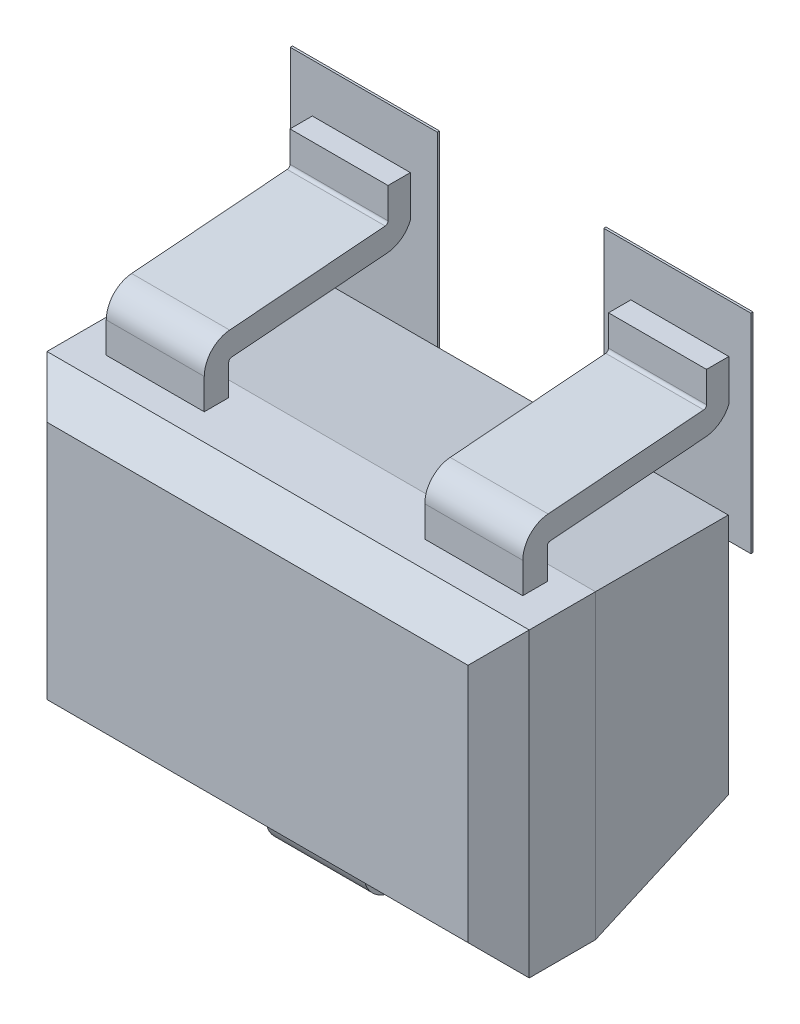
ISO-10303-21;
HEADER;
FILE_DESCRIPTION(('STEP AP214'),'2;1');
FILE_NAME('part.step','',(''),(''),'','','');
FILE_SCHEMA(('AUTOMOTIVE_DESIGN { 1 0 10303 214 1 1 1 1 }'));
ENDSEC;
DATA;
#1=APPLICATION_CONTEXT('core data for automotive mechanical design processes');
#2=APPLICATION_PROTOCOL_DEFINITION('international standard','automotive_design',2000,#1);
#3=PRODUCT_CONTEXT('',#1,'mechanical');
#4=PRODUCT('Part','Part','',(#3));
#5=PRODUCT_RELATED_PRODUCT_CATEGORY('part','',(#4));
#6=PRODUCT_DEFINITION_FORMATION('','',#4);
#7=PRODUCT_DEFINITION_CONTEXT('part definition',#1,'design');
#8=PRODUCT_DEFINITION('design','',#6,#7);
#9=PRODUCT_DEFINITION_SHAPE('','',#8);
#10=(LENGTH_UNIT() NAMED_UNIT(*) SI_UNIT(.MILLI.,.METRE.));
#11=(NAMED_UNIT(*) PLANE_ANGLE_UNIT() SI_UNIT($,.RADIAN.));
#12=(NAMED_UNIT(*) SI_UNIT($,.STERADIAN.) SOLID_ANGLE_UNIT());
#13=UNCERTAINTY_MEASURE_WITH_UNIT(LENGTH_MEASURE(1.E-05),#10,'distance_accuracy_value','');
#14=(GEOMETRIC_REPRESENTATION_CONTEXT(3) GLOBAL_UNCERTAINTY_ASSIGNED_CONTEXT((#13)) GLOBAL_UNIT_ASSIGNED_CONTEXT((#10,
#11,#12)) REPRESENTATION_CONTEXT('',''));
#15=CARTESIAN_POINT('',(0.,0.,0.));
#16=DIRECTION('',(0.,0.,1.));
#17=DIRECTION('',(1.,0.,0.));
#18=AXIS2_PLACEMENT_3D('',#15,#16,#17);
#19=CARTESIAN_POINT('',(-0.2032,-0.91329000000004,0.0762));
#20=DIRECTION('',(0.,0.,-1.));
#21=DIRECTION('',(-1.,0.,0.));
#22=AXIS2_PLACEMENT_3D('',#19,#20,#21);
#23=PLANE('',#22);
#24=DIRECTION('',(0.,1.,0.));
#25=VECTOR('',#24,1.);
#26=CARTESIAN_POINT('',(-0.95499999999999,1.25800000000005,0.0762));
#27=LINE('',#26,#25);
#28=CARTESIAN_POINT('',(-0.95499999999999,1.25800000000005,0.0762));
#29=VERTEX_POINT('',#28);
#30=CARTESIAN_POINT('',(-0.95499999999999,0.393999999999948,0.0762));
#31=VERTEX_POINT('',#30);
#32=EDGE_CURVE('E701',#29,#31,#27,.F.);
#33=ORIENTED_EDGE('',*,*,#32,.F.);
#34=DIRECTION('',(1.,0.,0.));
#35=VECTOR('',#34,1.);
#36=CARTESIAN_POINT('',(-0.34499999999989,1.25800000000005,0.0762));
#37=LINE('',#36,#35);
#38=CARTESIAN_POINT('',(-0.34499999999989,1.25800000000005,0.0762));
#39=VERTEX_POINT('',#38);
#40=EDGE_CURVE('E683',#39,#29,#37,.F.);
#41=ORIENTED_EDGE('',*,*,#40,.F.);
#42=DIRECTION('',(0.,1.,0.));
#43=VECTOR('',#42,1.);
#44=CARTESIAN_POINT('',(-0.34499999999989,0.393999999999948,0.0762));
#45=LINE('',#44,#43);
#46=CARTESIAN_POINT('',(-0.34499999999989,0.393999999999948,0.0762));
#47=VERTEX_POINT('',#46);
#48=EDGE_CURVE('E691',#47,#39,#45,.T.);
#49=ORIENTED_EDGE('',*,*,#48,.F.);
#50=DIRECTION('',(1.,0.,0.));
#51=VECTOR('',#50,1.);
#52=CARTESIAN_POINT('',(-0.95499999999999,0.393999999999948,0.0762));
#53=LINE('',#52,#51);
#54=EDGE_CURVE('E696',#31,#47,#53,.T.);
#55=ORIENTED_EDGE('',*,*,#54,.F.);
#56=EDGE_LOOP('',(#33,#41,#49,#55));
#57=FACE_BOUND('',#56,.T.);
#58=ADVANCED_FACE('F16',(#57),#23,.T.);
#59=CARTESIAN_POINT('',(-0.2032,-0.91329000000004,0.0762));
#60=DIRECTION('',(0.,0.,-1.));
#61=DIRECTION('',(-1.,0.,0.));
#62=AXIS2_PLACEMENT_3D('',#59,#60,#61);
#63=PLANE('',#62);
#64=DIRECTION('',(1.,0.,0.));
#65=VECTOR('',#64,1.);
#66=CARTESIAN_POINT('',(0.34499999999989,0.393999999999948,0.0762));
#67=LINE('',#66,#65);
#68=CARTESIAN_POINT('',(0.34499999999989,0.393999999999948,0.0762));
#69=VERTEX_POINT('',#68);
#70=CARTESIAN_POINT('',(0.95499999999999,0.393999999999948,0.0762));
#71=VERTEX_POINT('',#70);
#72=EDGE_CURVE('E681',#69,#71,#67,.T.);
#73=ORIENTED_EDGE('',*,*,#72,.F.);
#74=DIRECTION('',(0.,1.,0.));
#75=VECTOR('',#74,1.);
#76=CARTESIAN_POINT('',(0.34499999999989,1.25800000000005,0.0762));
#77=LINE('',#76,#75);
#78=CARTESIAN_POINT('',(0.34499999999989,1.25800000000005,0.0762));
#79=VERTEX_POINT('',#78);
#80=EDGE_CURVE('E663',#79,#69,#77,.F.);
#81=ORIENTED_EDGE('',*,*,#80,.F.);
#82=DIRECTION('',(1.,0.,0.));
#83=VECTOR('',#82,1.);
#84=CARTESIAN_POINT('',(0.95499999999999,1.25800000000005,0.0762));
#85=LINE('',#84,#83);
#86=CARTESIAN_POINT('',(0.95499999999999,1.25800000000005,0.0762));
#87=VERTEX_POINT('',#86);
#88=EDGE_CURVE('E671',#87,#79,#85,.F.);
#89=ORIENTED_EDGE('',*,*,#88,.F.);
#90=DIRECTION('',(0.,1.,0.));
#91=VECTOR('',#90,1.);
#92=CARTESIAN_POINT('',(0.95499999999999,0.393999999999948,0.0762));
#93=LINE('',#92,#91);
#94=EDGE_CURVE('E676',#71,#87,#93,.T.);
#95=ORIENTED_EDGE('',*,*,#94,.F.);
#96=EDGE_LOOP('',(#73,#81,#89,#95));
#97=FACE_BOUND('',#96,.T.);
#98=ADVANCED_FACE('F1175',(#97),#63,.T.);
#99=CARTESIAN_POINT('',(-0.2032,-0.91329000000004,0.0762));
#100=DIRECTION('',(0.,0.,-1.));
#101=DIRECTION('',(-1.,0.,0.));
#102=AXIS2_PLACEMENT_3D('',#99,#100,#101);
#103=PLANE('',#102);
#104=DIRECTION('',(1.,0.,0.));
#105=VECTOR('',#104,1.);
#106=CARTESIAN_POINT('',(-0.30500000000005,-1.25100000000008,0.0762));
#107=LINE('',#106,#105);
#108=CARTESIAN_POINT('',(-0.30500000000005,-1.25100000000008,0.0762));
#109=VERTEX_POINT('',#108);
#110=CARTESIAN_POINT('',(0.30500000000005,-1.25100000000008,0.0762));
#111=VERTEX_POINT('',#110);
#112=EDGE_CURVE('E661',#109,#111,#107,.T.);
#113=ORIENTED_EDGE('',*,*,#112,.F.);
#114=DIRECTION('',(0.,1.,0.));
#115=VECTOR('',#114,1.);
#116=CARTESIAN_POINT('',(-0.30500000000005,-0.386999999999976,0.0762));
#117=LINE('',#116,#115);
#118=CARTESIAN_POINT('',(-0.30500000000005,-0.386999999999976,0.0762));
#119=VERTEX_POINT('',#118);
#120=EDGE_CURVE('E632',#119,#109,#117,.F.);
#121=ORIENTED_EDGE('',*,*,#120,.F.);
#122=DIRECTION('',(1.,0.,0.));
#123=VECTOR('',#122,1.);
#124=CARTESIAN_POINT('',(0.30500000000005,-0.386999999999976,0.0762));
#125=LINE('',#124,#123);
#126=CARTESIAN_POINT('',(0.30500000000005,-0.386999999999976,0.0762));
#127=VERTEX_POINT('',#126);
#128=EDGE_CURVE('E651',#127,#119,#125,.F.);
#129=ORIENTED_EDGE('',*,*,#128,.F.);
#130=DIRECTION('',(0.,1.,0.));
#131=VECTOR('',#130,1.);
#132=CARTESIAN_POINT('',(0.30500000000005,-1.25100000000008,0.0762));
#133=LINE('',#132,#131);
#134=EDGE_CURVE('E656',#111,#127,#133,.T.);
#135=ORIENTED_EDGE('',*,*,#134,.F.);
#136=EDGE_LOOP('',(#113,#121,#129,#135));
#137=FACE_BOUND('',#136,.T.);
#138=ADVANCED_FACE('F1172',(#137),#103,.T.);
#139=CARTESIAN_POINT('',(-0.95499999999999,1.25800000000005,0.0762));
#140=DIRECTION('',(-1.,0.,0.));
#141=DIRECTION('',(0.,0.,1.));
#142=AXIS2_PLACEMENT_3D('',#139,#140,#141);
#143=PLANE('',#142);
#144=DIRECTION('',(0.,0.,1.));
#145=VECTOR('',#144,1.);
#146=CARTESIAN_POINT('',(-0.95499999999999,1.25800000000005,0.0762));
#147=LINE('',#146,#145);
#148=CARTESIAN_POINT('',(-0.95499999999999,1.25800000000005,0.0851999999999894));
#149=VERTEX_POINT('',#148);
#150=EDGE_CURVE('E689',#29,#149,#147,.T.);
#151=ORIENTED_EDGE('',*,*,#150,.F.);
#152=ORIENTED_EDGE('',*,*,#32,.T.);
#153=DIRECTION('',(0.,0.,-1.));
#154=VECTOR('',#153,1.);
#155=CARTESIAN_POINT('',(-0.95499999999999,0.393999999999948,0.0762));
#156=LINE('',#155,#154);
#157=CARTESIAN_POINT('',(-0.95499999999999,0.393999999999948,0.0851999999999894));
#158=VERTEX_POINT('',#157);
#159=EDGE_CURVE('E698',#158,#31,#156,.T.);
#160=ORIENTED_EDGE('',*,*,#159,.F.);
#161=DIRECTION('',(0.,1.,0.));
#162=VECTOR('',#161,1.);
#163=CARTESIAN_POINT('',(-0.95499999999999,0.,0.0851999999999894));
#164=LINE('',#163,#162);
#165=EDGE_CURVE('E381',#149,#158,#164,.F.);
#166=ORIENTED_EDGE('',*,*,#165,.F.);
#167=EDGE_LOOP('',(#151,#152,#160,#166));
#168=FACE_BOUND('',#167,.T.);
#169=ADVANCED_FACE('F1168',(#168),#143,.T.);
#170=CARTESIAN_POINT('',(-0.95499999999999,0.393999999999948,0.0762));
#171=DIRECTION('',(0.,-1.,0.));
#172=DIRECTION('',(0.,0.,-1.));
#173=AXIS2_PLACEMENT_3D('',#170,#171,#172);
#174=PLANE('',#173);
#175=ORIENTED_EDGE('',*,*,#159,.T.);
#176=ORIENTED_EDGE('',*,*,#54,.T.);
#177=DIRECTION('',(0.,0.,-1.));
#178=VECTOR('',#177,1.);
#179=CARTESIAN_POINT('',(-0.34499999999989,0.393999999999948,0.0762));
#180=LINE('',#179,#178);
#181=CARTESIAN_POINT('',(-0.34499999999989,0.393999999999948,0.0851999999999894));
#182=VERTEX_POINT('',#181);
#183=EDGE_CURVE('E693',#182,#47,#180,.T.);
#184=ORIENTED_EDGE('',*,*,#183,.F.);
#185=DIRECTION('',(1.,0.,0.));
#186=VECTOR('',#185,1.);
#187=CARTESIAN_POINT('',(0.,0.393999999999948,0.0851999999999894));
#188=LINE('',#187,#186);
#189=EDGE_CURVE('E604',#158,#182,#188,.T.);
#190=ORIENTED_EDGE('',*,*,#189,.F.);
#191=EDGE_LOOP('',(#175,#176,#184,#190));
#192=FACE_BOUND('',#191,.T.);
#193=ADVANCED_FACE('F1164',(#192),#174,.T.);
#194=CARTESIAN_POINT('',(-0.34499999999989,0.393999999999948,0.0762));
#195=DIRECTION('',(1.,0.,0.));
#196=DIRECTION('',(0.,0.,-1.));
#197=AXIS2_PLACEMENT_3D('',#194,#195,#196);
#198=PLANE('',#197);
#199=ORIENTED_EDGE('',*,*,#183,.T.);
#200=ORIENTED_EDGE('',*,*,#48,.T.);
#201=DIRECTION('',(0.,0.,1.));
#202=VECTOR('',#201,1.);
#203=CARTESIAN_POINT('',(-0.34499999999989,1.25800000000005,0.0762));
#204=LINE('',#203,#202);
#205=CARTESIAN_POINT('',(-0.34499999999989,1.25800000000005,0.0851999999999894));
#206=VERTEX_POINT('',#205);
#207=EDGE_CURVE('E686',#206,#39,#204,.F.);
#208=ORIENTED_EDGE('',*,*,#207,.F.);
#209=DIRECTION('',(0.,1.,0.));
#210=VECTOR('',#209,1.);
#211=CARTESIAN_POINT('',(-0.34499999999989,0.,0.0851999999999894));
#212=LINE('',#211,#210);
#213=EDGE_CURVE('E602',#182,#206,#212,.T.);
#214=ORIENTED_EDGE('',*,*,#213,.F.);
#215=EDGE_LOOP('',(#199,#200,#208,#214));
#216=FACE_BOUND('',#215,.T.);
#217=ADVANCED_FACE('F1160',(#216),#198,.T.);
#218=CARTESIAN_POINT('',(-0.34499999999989,1.25800000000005,0.0762));
#219=DIRECTION('',(0.,1.,0.));
#220=DIRECTION('',(0.,0.,1.));
#221=AXIS2_PLACEMENT_3D('',#218,#219,#220);
#222=PLANE('',#221);
#223=ORIENTED_EDGE('',*,*,#207,.T.);
#224=ORIENTED_EDGE('',*,*,#40,.T.);
#225=ORIENTED_EDGE('',*,*,#150,.T.);
#226=DIRECTION('',(1.,0.,0.));
#227=VECTOR('',#226,1.);
#228=CARTESIAN_POINT('',(0.,1.25800000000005,0.0851999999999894));
#229=LINE('',#228,#227);
#230=EDGE_CURVE('E599',#206,#149,#229,.F.);
#231=ORIENTED_EDGE('',*,*,#230,.F.);
#232=EDGE_LOOP('',(#223,#224,#225,#231));
#233=FACE_BOUND('',#232,.T.);
#234=ADVANCED_FACE('F1156',(#233),#222,.T.);
#235=CARTESIAN_POINT('',(0.34499999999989,0.393999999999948,0.0762));
#236=DIRECTION('',(0.,-1.,0.));
#237=DIRECTION('',(0.,0.,-1.));
#238=AXIS2_PLACEMENT_3D('',#235,#236,#237);
#239=PLANE('',#238);
#240=DIRECTION('',(0.,0.,1.));
#241=VECTOR('',#240,1.);
#242=CARTESIAN_POINT('',(0.34499999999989,0.393999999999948,0.0762));
#243=LINE('',#242,#241);
#244=CARTESIAN_POINT('',(0.34499999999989,0.393999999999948,0.0851999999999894));
#245=VERTEX_POINT('',#244);
#246=EDGE_CURVE('E669',#69,#245,#243,.T.);
#247=ORIENTED_EDGE('',*,*,#246,.F.);
#248=ORIENTED_EDGE('',*,*,#72,.T.);
#249=DIRECTION('',(0.,0.,-1.));
#250=VECTOR('',#249,1.);
#251=CARTESIAN_POINT('',(0.95499999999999,0.393999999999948,0.0762));
#252=LINE('',#251,#250);
#253=CARTESIAN_POINT('',(0.95499999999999,0.393999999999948,0.0851999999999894));
#254=VERTEX_POINT('',#253);
#255=EDGE_CURVE('E678',#254,#71,#252,.T.);
#256=ORIENTED_EDGE('',*,*,#255,.F.);
#257=DIRECTION('',(1.,0.,0.));
#258=VECTOR('',#257,1.);
#259=CARTESIAN_POINT('',(0.,0.393999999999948,0.0851999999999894));
#260=LINE('',#259,#258);
#261=EDGE_CURVE('E554',#245,#254,#260,.T.);
#262=ORIENTED_EDGE('',*,*,#261,.F.);
#263=EDGE_LOOP('',(#247,#248,#256,#262));
#264=FACE_BOUND('',#263,.T.);
#265=ADVANCED_FACE('F1152',(#264),#239,.T.);
#266=CARTESIAN_POINT('',(0.95499999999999,0.393999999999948,0.0762));
#267=DIRECTION('',(1.,0.,0.));
#268=DIRECTION('',(0.,0.,-1.));
#269=AXIS2_PLACEMENT_3D('',#266,#267,#268);
#270=PLANE('',#269);
#271=ORIENTED_EDGE('',*,*,#255,.T.);
#272=ORIENTED_EDGE('',*,*,#94,.T.);
#273=DIRECTION('',(0.,0.,1.));
#274=VECTOR('',#273,1.);
#275=CARTESIAN_POINT('',(0.95499999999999,1.25800000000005,0.0762));
#276=LINE('',#275,#274);
#277=CARTESIAN_POINT('',(0.95499999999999,1.25800000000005,0.0851999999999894));
#278=VERTEX_POINT('',#277);
#279=EDGE_CURVE('E673',#278,#87,#276,.F.);
#280=ORIENTED_EDGE('',*,*,#279,.F.);
#281=DIRECTION('',(0.,1.,0.));
#282=VECTOR('',#281,1.);
#283=CARTESIAN_POINT('',(0.95499999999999,0.,0.0851999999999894));
#284=LINE('',#283,#282);
#285=EDGE_CURVE('E552',#254,#278,#284,.T.);
#286=ORIENTED_EDGE('',*,*,#285,.F.);
#287=EDGE_LOOP('',(#271,#272,#280,#286));
#288=FACE_BOUND('',#287,.T.);
#289=ADVANCED_FACE('F1148',(#288),#270,.T.);
#290=CARTESIAN_POINT('',(0.95499999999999,1.25800000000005,0.0762));
#291=DIRECTION('',(0.,1.,0.));
#292=DIRECTION('',(0.,0.,1.));
#293=AXIS2_PLACEMENT_3D('',#290,#291,#292);
#294=PLANE('',#293);
#295=ORIENTED_EDGE('',*,*,#279,.T.);
#296=ORIENTED_EDGE('',*,*,#88,.T.);
#297=DIRECTION('',(0.,0.,1.));
#298=VECTOR('',#297,1.);
#299=CARTESIAN_POINT('',(0.34499999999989,1.25800000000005,0.0762));
#300=LINE('',#299,#298);
#301=CARTESIAN_POINT('',(0.34499999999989,1.25800000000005,0.0851999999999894));
#302=VERTEX_POINT('',#301);
#303=EDGE_CURVE('E666',#302,#79,#300,.F.);
#304=ORIENTED_EDGE('',*,*,#303,.F.);
#305=DIRECTION('',(1.,0.,0.));
#306=VECTOR('',#305,1.);
#307=CARTESIAN_POINT('',(0.,1.25800000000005,0.0851999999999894));
#308=LINE('',#307,#306);
#309=EDGE_CURVE('E550',#278,#302,#308,.F.);
#310=ORIENTED_EDGE('',*,*,#309,.F.);
#311=EDGE_LOOP('',(#295,#296,#304,#310));
#312=FACE_BOUND('',#311,.T.);
#313=ADVANCED_FACE('F1144',(#312),#294,.T.);
#314=CARTESIAN_POINT('',(0.34499999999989,1.25800000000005,0.0762));
#315=DIRECTION('',(-1.,0.,0.));
#316=DIRECTION('',(0.,0.,1.));
#317=AXIS2_PLACEMENT_3D('',#314,#315,#316);
#318=PLANE('',#317);
#319=ORIENTED_EDGE('',*,*,#303,.T.);
#320=ORIENTED_EDGE('',*,*,#80,.T.);
#321=ORIENTED_EDGE('',*,*,#246,.T.);
#322=DIRECTION('',(0.,1.,0.));
#323=VECTOR('',#322,1.);
#324=CARTESIAN_POINT('',(0.34499999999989,0.,0.0851999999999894));
#325=LINE('',#324,#323);
#326=EDGE_CURVE('E547',#302,#245,#325,.F.);
#327=ORIENTED_EDGE('',*,*,#326,.F.);
#328=EDGE_LOOP('',(#319,#320,#321,#327));
#329=FACE_BOUND('',#328,.T.);
#330=ADVANCED_FACE('F1140',(#329),#318,.T.);
#331=CARTESIAN_POINT('',(-0.30500000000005,-1.25100000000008,0.0762));
#332=DIRECTION('',(0.,-1.,0.));
#333=DIRECTION('',(0.,0.,-1.));
#334=AXIS2_PLACEMENT_3D('',#331,#332,#333);
#335=PLANE('',#334);
#336=DIRECTION('',(0.,0.,1.));
#337=VECTOR('',#336,1.);
#338=CARTESIAN_POINT('',(-0.30500000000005,-1.25100000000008,0.0762));
#339=LINE('',#338,#337);
#340=CARTESIAN_POINT('',(-0.30500000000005,-1.25100000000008,0.0851999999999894));
#341=VERTEX_POINT('',#340);
#342=EDGE_CURVE('E649',#109,#341,#339,.T.);
#343=ORIENTED_EDGE('',*,*,#342,.F.);
#344=ORIENTED_EDGE('',*,*,#112,.T.);
#345=DIRECTION('',(0.,0.,-1.));
#346=VECTOR('',#345,1.);
#347=CARTESIAN_POINT('',(0.30500000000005,-1.25100000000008,0.0762));
#348=LINE('',#347,#346);
#349=CARTESIAN_POINT('',(0.30500000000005,-1.25100000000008,0.0851999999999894));
#350=VERTEX_POINT('',#349);
#351=EDGE_CURVE('E658',#350,#111,#348,.T.);
#352=ORIENTED_EDGE('',*,*,#351,.F.);
#353=DIRECTION('',(1.,0.,0.));
#354=VECTOR('',#353,1.);
#355=CARTESIAN_POINT('',(0.,-1.25100000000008,0.0851999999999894));
#356=LINE('',#355,#354);
#357=EDGE_CURVE('E444',#341,#350,#356,.T.);
#358=ORIENTED_EDGE('',*,*,#357,.F.);
#359=EDGE_LOOP('',(#343,#344,#352,#358));
#360=FACE_BOUND('',#359,.T.);
#361=ADVANCED_FACE('F1136',(#360),#335,.T.);
#362=CARTESIAN_POINT('',(0.30500000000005,-1.25100000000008,0.0762));
#363=DIRECTION('',(1.,0.,0.));
#364=DIRECTION('',(0.,0.,-1.));
#365=AXIS2_PLACEMENT_3D('',#362,#363,#364);
#366=PLANE('',#365);
#367=ORIENTED_EDGE('',*,*,#351,.T.);
#368=ORIENTED_EDGE('',*,*,#134,.T.);
#369=DIRECTION('',(0.,0.,1.));
#370=VECTOR('',#369,1.);
#371=CARTESIAN_POINT('',(0.30500000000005,-0.386999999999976,0.0762));
#372=LINE('',#371,#370);
#373=CARTESIAN_POINT('',(0.30500000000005,-0.386999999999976,0.0851999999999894));
#374=VERTEX_POINT('',#373);
#375=EDGE_CURVE('E653',#374,#127,#372,.F.);
#376=ORIENTED_EDGE('',*,*,#375,.F.);
#377=DIRECTION('',(0.,1.,0.));
#378=VECTOR('',#377,1.);
#379=CARTESIAN_POINT('',(0.30500000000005,0.,0.0851999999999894));
#380=LINE('',#379,#378);
#381=EDGE_CURVE('E442',#350,#374,#380,.T.);
#382=ORIENTED_EDGE('',*,*,#381,.F.);
#383=EDGE_LOOP('',(#367,#368,#376,#382));
#384=FACE_BOUND('',#383,.T.);
#385=ADVANCED_FACE('F1132',(#384),#366,.T.);
#386=CARTESIAN_POINT('',(0.30500000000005,-0.386999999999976,0.0762));
#387=DIRECTION('',(0.,1.,0.));
#388=DIRECTION('',(0.,0.,1.));
#389=AXIS2_PLACEMENT_3D('',#386,#387,#388);
#390=PLANE('',#389);
#391=ORIENTED_EDGE('',*,*,#375,.T.);
#392=ORIENTED_EDGE('',*,*,#128,.T.);
#393=DIRECTION('',(0.,0.,1.));
#394=VECTOR('',#393,1.);
#395=CARTESIAN_POINT('',(-0.30500000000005,-0.386999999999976,0.0762));
#396=LINE('',#395,#394);
#397=CARTESIAN_POINT('',(-0.30500000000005,-0.386999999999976,0.0851999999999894));
#398=VERTEX_POINT('',#397);
#399=EDGE_CURVE('E646',#398,#119,#396,.F.);
#400=ORIENTED_EDGE('',*,*,#399,.F.);
#401=DIRECTION('',(1.,0.,0.));
#402=VECTOR('',#401,1.);
#403=CARTESIAN_POINT('',(0.,-0.386999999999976,0.0851999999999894));
#404=LINE('',#403,#402);
#405=EDGE_CURVE('E440',#374,#398,#404,.F.);
#406=ORIENTED_EDGE('',*,*,#405,.F.);
#407=EDGE_LOOP('',(#391,#392,#400,#406));
#408=FACE_BOUND('',#407,.T.);
#409=ADVANCED_FACE('F1128',(#408),#390,.T.);
#410=CARTESIAN_POINT('',(-0.30500000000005,-0.386999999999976,0.0762));
#411=DIRECTION('',(-1.,0.,0.));
#412=DIRECTION('',(0.,0.,1.));
#413=AXIS2_PLACEMENT_3D('',#410,#411,#412);
#414=PLANE('',#413);
#415=ORIENTED_EDGE('',*,*,#399,.T.);
#416=ORIENTED_EDGE('',*,*,#120,.T.);
#417=ORIENTED_EDGE('',*,*,#342,.T.);
#418=DIRECTION('',(0.,1.,0.));
#419=VECTOR('',#418,1.);
#420=CARTESIAN_POINT('',(-0.30500000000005,0.,0.0851999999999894));
#421=LINE('',#420,#419);
#422=EDGE_CURVE('E436',#398,#341,#421,.F.);
#423=ORIENTED_EDGE('',*,*,#422,.F.);
#424=EDGE_LOOP('',(#415,#416,#417,#423));
#425=FACE_BOUND('',#424,.T.);
#426=ADVANCED_FACE('F1124',(#425),#414,.T.);
#427=CARTESIAN_POINT('',(-0.6604,1.05680000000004,0.127));
#428=DIRECTION('',(0.,1.,0.));
#429=DIRECTION('',(0.,0.,1.));
#430=AXIS2_PLACEMENT_3D('',#427,#428,#429);
#431=PLANE('',#430);
#432=DIRECTION('',(0.,0.,-1.));
#433=VECTOR('',#432,1.);
#434=CARTESIAN_POINT('',(-0.4572,1.05680000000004,0.9398));
#435=LINE('',#434,#433);
#436=CARTESIAN_POINT('',(-0.4572,1.05680000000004,0.0851999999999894));
#437=VERTEX_POINT('',#436);
#438=CARTESIAN_POINT('',(-0.4572,1.05680000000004,0.1778));
#439=VERTEX_POINT('',#438);
#440=EDGE_CURVE('E612',#437,#439,#435,.F.);
#441=ORIENTED_EDGE('',*,*,#440,.F.);
#442=DIRECTION('',(1.,0.,0.));
#443=VECTOR('',#442,1.);
#444=CARTESIAN_POINT('',(0.,1.05680000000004,0.0851999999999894));
#445=LINE('',#444,#443);
#446=CARTESIAN_POINT('',(-0.8636,1.05680000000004,0.0851999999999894));
#447=VERTEX_POINT('',#446);
#448=EDGE_CURVE('E608',#447,#437,#445,.T.);
#449=ORIENTED_EDGE('',*,*,#448,.F.);
#450=DIRECTION('',(0.,0.,1.));
#451=VECTOR('',#450,1.);
#452=CARTESIAN_POINT('',(-0.8636,1.05680000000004,0.8382));
#453=LINE('',#452,#451);
#454=CARTESIAN_POINT('',(-0.8636,1.05680000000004,0.1778));
#455=VERTEX_POINT('',#454);
#456=EDGE_CURVE('E639',#455,#447,#453,.F.);
#457=ORIENTED_EDGE('',*,*,#456,.F.);
#458=DIRECTION('',(1.,0.,0.));
#459=VECTOR('',#458,1.);
#460=CARTESIAN_POINT('',(-0.8636,1.05680000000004,0.1778));
#461=LINE('',#460,#459);
#462=EDGE_CURVE('E630',#439,#455,#461,.F.);
#463=ORIENTED_EDGE('',*,*,#462,.F.);
#464=EDGE_LOOP('',(#441,#449,#457,#463));
#465=FACE_BOUND('',#464,.T.);
#466=ADVANCED_FACE('F1121',(#465),#431,.T.);
#467=CARTESIAN_POINT('',(-0.8636,0.92980000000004,0.1778));
#468=DIRECTION('',(0.,0.,1.));
#469=DIRECTION('',(1.,0.,0.));
#470=AXIS2_PLACEMENT_3D('',#467,#468,#469);
#471=PLANE('',#470);
#472=DIRECTION('',(0.,1.,0.));
#473=VECTOR('',#472,1.);
#474=CARTESIAN_POINT('',(-0.8636,0.62500000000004,0.1778));
#475=LINE('',#474,#473);
#476=CARTESIAN_POINT('',(-0.863599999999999,0.92980000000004,0.1778));
#477=VERTEX_POINT('',#476);
#478=EDGE_CURVE('E641',#477,#455,#475,.T.);
#479=ORIENTED_EDGE('',*,*,#478,.F.);
#480=DIRECTION('',(1.,0.,0.));
#481=VECTOR('',#480,1.);
#482=CARTESIAN_POINT('',(-26.0604,0.92980000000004,0.1778));
#483=LINE('',#482,#481);
#484=CARTESIAN_POINT('',(-0.457200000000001,0.92980000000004,0.1778));
#485=VERTEX_POINT('',#484);
#486=EDGE_CURVE('E627',#477,#485,#483,.T.);
#487=ORIENTED_EDGE('',*,*,#486,.T.);
#488=DIRECTION('',(0.,1.,0.));
#489=VECTOR('',#488,1.);
#490=CARTESIAN_POINT('',(-0.4572,0.62500000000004,0.1778));
#491=LINE('',#490,#489);
#492=EDGE_CURVE('E614',#439,#485,#491,.F.);
#493=ORIENTED_EDGE('',*,*,#492,.F.);
#494=ORIENTED_EDGE('',*,*,#462,.T.);
#495=EDGE_LOOP('',(#479,#487,#493,#494));
#496=FACE_BOUND('',#495,.T.);
#497=ADVANCED_FACE('F785',(#496),#471,.T.);
#498=CARTESIAN_POINT('',(-26.0604,0.92980000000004,0.1905));
#499=DIRECTION('',(1.,0.,0.));
#500=DIRECTION('',(0.,0.,-1.));
#501=AXIS2_PLACEMENT_3D('',#498,#499,#500);
#502=CYLINDRICAL_SURFACE('',#501,0.0127);
#503=ORIENTED_EDGE('',*,*,#486,.F.);
#504=CARTESIAN_POINT('',(-0.863599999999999,0.92980000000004,0.1905));
#505=DIRECTION('',(1.,0.,0.));
#506=DIRECTION('',(0.,0.,-1.));
#507=AXIS2_PLACEMENT_3D('',#504,#505,#506);
#508=CIRCLE('',#507,0.0127);
#509=CARTESIAN_POINT('',(-0.863599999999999,0.917139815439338,0.189495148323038));
#510=VERTEX_POINT('',#509);
#511=EDGE_CURVE('E765',#510,#477,#508,.T.);
#512=ORIENTED_EDGE('',*,*,#511,.F.);
#513=DIRECTION('',(1.,0.,0.));
#514=VECTOR('',#513,1.);
#515=CARTESIAN_POINT('',(-0.8636,0.917139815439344,0.189495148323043));
#516=LINE('',#515,#514);
#517=CARTESIAN_POINT('',(-0.457200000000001,0.917139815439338,0.189495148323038));
#518=VERTEX_POINT('',#517);
#519=EDGE_CURVE('E619',#518,#510,#516,.F.);
#520=ORIENTED_EDGE('',*,*,#519,.F.);
#521=CARTESIAN_POINT('',(-0.457200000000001,0.92980000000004,0.1905));
#522=DIRECTION('',(1.,0.,0.));
#523=DIRECTION('',(0.,0.,-1.));
#524=AXIS2_PLACEMENT_3D('',#521,#522,#523);
#525=CIRCLE('',#524,0.0127);
#526=EDGE_CURVE('E763',#485,#518,#525,.F.);
#527=ORIENTED_EDGE('',*,*,#526,.F.);
#528=EDGE_LOOP('',(#503,#512,#520,#527));
#529=FACE_BOUND('',#528,.T.);
#530=ADVANCED_FACE('F780',(#529),#502,.F.);
#531=CARTESIAN_POINT('',(-0.8636,0.865941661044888,0.83454366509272));
#532=DIRECTION('',(0.,0.996864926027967,0.0791221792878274));
#533=DIRECTION('',(0.,-0.0791221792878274,0.996864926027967));
#534=AXIS2_PLACEMENT_3D('',#531,#532,#533);
#535=PLANE('',#534);
#536=DIRECTION('',(0.,0.0791221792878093,-0.996864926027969));
#537=VECTOR('',#536,1.);
#538=CARTESIAN_POINT('',(-0.8636,0.865941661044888,0.83454366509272));
#539=LINE('',#538,#537);
#540=CARTESIAN_POINT('',(-0.863599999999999,0.865941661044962,0.834543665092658));
#541=VERTEX_POINT('',#540);
#542=EDGE_CURVE('E398',#541,#510,#539,.T.);
#543=ORIENTED_EDGE('',*,*,#542,.F.);
#544=DIRECTION('',(-1.,0.,0.));
#545=VECTOR('',#544,1.);
#546=CARTESIAN_POINT('',(24.7396,0.865941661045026,0.834543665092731));
#547=LINE('',#546,#545);
#548=CARTESIAN_POINT('',(-0.457200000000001,0.865941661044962,0.834543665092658));
#549=VERTEX_POINT('',#548);
#550=EDGE_CURVE('E556',#549,#541,#547,.T.);
#551=ORIENTED_EDGE('',*,*,#550,.F.);
#552=DIRECTION('',(0.,-0.0791221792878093,0.996864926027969));
#553=VECTOR('',#552,1.);
#554=CARTESIAN_POINT('',(-0.4572,0.917139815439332,0.189495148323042));
#555=LINE('',#554,#553);
#556=EDGE_CURVE('E762',#518,#549,#555,.T.);
#557=ORIENTED_EDGE('',*,*,#556,.F.);
#558=ORIENTED_EDGE('',*,*,#519,.T.);
#559=EDGE_LOOP('',(#543,#551,#557,#558));
#560=FACE_BOUND('',#559,.T.);
#561=ADVANCED_FACE('F1113',(#560),#535,.T.);
#562=CARTESIAN_POINT('',(24.7396,0.75200000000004,0.8255));
#563=DIRECTION('',(-1.,0.,0.));
#564=DIRECTION('',(0.,0.,1.));
#565=AXIS2_PLACEMENT_3D('',#562,#563,#564);
#566=CYLINDRICAL_SURFACE('',#565,0.0127);
#567=DIRECTION('',(1.,0.,0.));
#568=VECTOR('',#567,1.);
#569=CARTESIAN_POINT('',(-0.4572,0.764660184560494,0.826504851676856));
#570=LINE('',#569,#568);
#571=CARTESIAN_POINT('',(-0.457200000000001,0.76466018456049,0.826504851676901));
#572=VERTEX_POINT('',#571);
#573=CARTESIAN_POINT('',(-0.863599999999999,0.76466018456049,0.826504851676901));
#574=VERTEX_POINT('',#573);
#575=EDGE_CURVE('E382',#572,#574,#570,.F.);
#576=ORIENTED_EDGE('',*,*,#575,.F.);
#577=CARTESIAN_POINT('',(-0.457200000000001,0.75200000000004,0.8255));
#578=DIRECTION('',(-1.,0.,0.));
#579=DIRECTION('',(0.,0.,1.));
#580=AXIS2_PLACEMENT_3D('',#577,#578,#579);
#581=CIRCLE('',#580,0.0127);
#582=CARTESIAN_POINT('',(-0.457200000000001,0.75200000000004,0.8382));
#583=VERTEX_POINT('',#582);
#584=EDGE_CURVE('E757',#583,#572,#581,.T.);
#585=ORIENTED_EDGE('',*,*,#584,.F.);
#586=DIRECTION('',(-1.,0.,0.));
#587=VECTOR('',#586,1.);
#588=CARTESIAN_POINT('',(-0.4572,0.75200000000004,0.8382));
#589=LINE('',#588,#587);
#590=CARTESIAN_POINT('',(-0.863599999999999,0.75200000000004,0.8382));
#591=VERTEX_POINT('',#590);
#592=EDGE_CURVE('E615',#591,#583,#589,.F.);
#593=ORIENTED_EDGE('',*,*,#592,.F.);
#594=CARTESIAN_POINT('',(-0.863599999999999,0.75200000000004,0.8255));
#595=DIRECTION('',(-1.,0.,0.));
#596=DIRECTION('',(0.,0.,1.));
#597=AXIS2_PLACEMENT_3D('',#594,#595,#596);
#598=CIRCLE('',#597,0.0127);
#599=EDGE_CURVE('E393',#574,#591,#598,.F.);
#600=ORIENTED_EDGE('',*,*,#599,.F.);
#601=EDGE_LOOP('',(#576,#585,#593,#600));
#602=FACE_BOUND('',#601,.T.);
#603=ADVANCED_FACE('F1110',(#602),#566,.F.);
#604=CARTESIAN_POINT('',(-0.4572,0.764660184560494,0.826504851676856));
#605=DIRECTION('',(0.,-0.996864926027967,-0.0791221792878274));
#606=DIRECTION('',(0.,0.0791221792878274,-0.996864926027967));
#607=AXIS2_PLACEMENT_3D('',#604,#605,#606);
#608=PLANE('',#607);
#609=DIRECTION('',(0.,0.0791221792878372,-0.996864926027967));
#610=VECTOR('',#609,1.);
#611=CARTESIAN_POINT('',(-0.4572,0.764660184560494,0.826504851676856));
#612=LINE('',#611,#610);
#613=CARTESIAN_POINT('',(-0.457200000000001,0.815858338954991,0.181456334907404));
#614=VERTEX_POINT('',#613);
#615=EDGE_CURVE('E756',#572,#614,#612,.T.);
#616=ORIENTED_EDGE('',*,*,#615,.F.);
#617=ORIENTED_EDGE('',*,*,#575,.T.);
#618=DIRECTION('',(0.,-0.0791221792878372,0.996864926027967));
#619=VECTOR('',#618,1.);
#620=CARTESIAN_POINT('',(-0.8636,0.815858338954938,0.181456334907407));
#621=LINE('',#620,#619);
#622=CARTESIAN_POINT('',(-0.863599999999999,0.815858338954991,0.181456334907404));
#623=VERTEX_POINT('',#622);
#624=EDGE_CURVE('E387',#623,#574,#621,.T.);
#625=ORIENTED_EDGE('',*,*,#624,.F.);
#626=DIRECTION('',(1.,0.,0.));
#627=VECTOR('',#626,1.);
#628=CARTESIAN_POINT('',(-26.0604,0.815858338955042,0.181456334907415));
#629=LINE('',#628,#627);
#630=EDGE_CURVE('E374',#614,#623,#629,.F.);
#631=ORIENTED_EDGE('',*,*,#630,.F.);
#632=EDGE_LOOP('',(#616,#617,#625,#631));
#633=FACE_BOUND('',#632,.T.);
#634=ADVANCED_FACE('F391',(#633),#608,.T.);
#635=CARTESIAN_POINT('',(-26.0604,0.92980000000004,0.1905));
#636=DIRECTION('',(1.,0.,0.));
#637=DIRECTION('',(0.,0.,-1.));
#638=AXIS2_PLACEMENT_3D('',#635,#636,#637);
#639=CYLINDRICAL_SURFACE('',#638,0.1143);
#640=CARTESIAN_POINT('',(-0.863599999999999,0.92980000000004,0.1905));
#641=DIRECTION('',(1.,0.,0.));
#642=DIRECTION('',(0.,0.,-1.));
#643=AXIS2_PLACEMENT_3D('',#640,#641,#642);
#644=CIRCLE('',#643,0.1143);
#645=CARTESIAN_POINT('',(-0.863599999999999,0.885343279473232,0.0851999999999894));
#646=VERTEX_POINT('',#645);
#647=EDGE_CURVE('E19',#646,#623,#644,.F.);
#648=ORIENTED_EDGE('',*,*,#647,.F.);
#649=DIRECTION('',(1.,0.,0.));
#650=VECTOR('',#649,1.);
#651=CARTESIAN_POINT('',(0.,0.885343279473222,0.0851999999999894));
#652=LINE('',#651,#650);
#653=CARTESIAN_POINT('',(-0.457200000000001,0.885343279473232,0.0851999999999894));
#654=VERTEX_POINT('',#653);
#655=EDGE_CURVE('E367',#654,#646,#652,.F.);
#656=ORIENTED_EDGE('',*,*,#655,.F.);
#657=CARTESIAN_POINT('',(-0.457200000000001,0.92980000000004,0.1905));
#658=DIRECTION('',(1.,0.,0.));
#659=DIRECTION('',(0.,0.,-1.));
#660=AXIS2_PLACEMENT_3D('',#657,#658,#659);
#661=CIRCLE('',#660,0.1143);
#662=EDGE_CURVE('E377',#614,#654,#661,.T.);
#663=ORIENTED_EDGE('',*,*,#662,.F.);
#664=ORIENTED_EDGE('',*,*,#630,.T.);
#665=EDGE_LOOP('',(#648,#656,#663,#664));
#666=FACE_BOUND('',#665,.T.);
#667=ADVANCED_FACE('F376',(#666),#639,.T.);
#668=CARTESIAN_POINT('',(0.,0.,0.0851999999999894));
#669=DIRECTION('',(0.,0.,1.));
#670=DIRECTION('',(1.,0.,0.));
#671=AXIS2_PLACEMENT_3D('',#668,#669,#670);
#672=PLANE('',#671);
#673=ORIENTED_EDGE('',*,*,#448,.T.);
#674=DIRECTION('',(0.,1.,0.));
#675=VECTOR('',#674,1.);
#676=CARTESIAN_POINT('',(-0.4572,0.62500000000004,0.0851999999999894));
#677=LINE('',#676,#675);
#678=EDGE_CURVE('E593',#654,#437,#677,.T.);
#679=ORIENTED_EDGE('',*,*,#678,.F.);
#680=ORIENTED_EDGE('',*,*,#655,.T.);
#681=DIRECTION('',(0.,1.,0.));
#682=VECTOR('',#681,1.);
#683=CARTESIAN_POINT('',(-0.8636,0.62500000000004,0.0851999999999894));
#684=LINE('',#683,#682);
#685=EDGE_CURVE('E389',#447,#646,#684,.F.);
#686=ORIENTED_EDGE('',*,*,#685,.F.);
#687=EDGE_LOOP('',(#673,#679,#680,#686));
#688=FACE_BOUND('',#687,.T.);
#689=ORIENTED_EDGE('',*,*,#213,.T.);
#690=ORIENTED_EDGE('',*,*,#230,.T.);
#691=ORIENTED_EDGE('',*,*,#165,.T.);
#692=ORIENTED_EDGE('',*,*,#189,.T.);
#693=EDGE_LOOP('',(#689,#690,#691,#692));
#694=FACE_BOUND('',#693,.T.);
#695=ADVANCED_FACE('F1102',(#688,#694),#672,.T.);
#696=CARTESIAN_POINT('',(24.7396,0.75200000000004,0.8255));
#697=DIRECTION('',(-1.,0.,0.));
#698=DIRECTION('',(0.,0.,1.));
#699=AXIS2_PLACEMENT_3D('',#696,#697,#698);
#700=CYLINDRICAL_SURFACE('',#699,0.1143);
#701=CARTESIAN_POINT('',(-0.863599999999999,0.75200000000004,0.8255));
#702=DIRECTION('',(-1.,0.,0.));
#703=DIRECTION('',(0.,0.,1.));
#704=AXIS2_PLACEMENT_3D('',#701,#702,#703);
#705=CIRCLE('',#704,0.1143);
#706=CARTESIAN_POINT('',(-0.863599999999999,0.75200000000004,0.9398));
#707=VERTEX_POINT('',#706);
#708=EDGE_CURVE('E395',#707,#541,#705,.T.);
#709=ORIENTED_EDGE('',*,*,#708,.F.);
#710=DIRECTION('',(1.,0.,0.));
#711=VECTOR('',#710,1.);
#712=CARTESIAN_POINT('',(-0.8636,0.75200000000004,0.9398));
#713=LINE('',#712,#711);
#714=CARTESIAN_POINT('',(-0.457200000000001,0.75200000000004,0.9398));
#715=VERTEX_POINT('',#714);
#716=EDGE_CURVE('E573',#715,#707,#713,.F.);
#717=ORIENTED_EDGE('',*,*,#716,.F.);
#718=CARTESIAN_POINT('',(-0.457200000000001,0.75200000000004,0.8255));
#719=DIRECTION('',(-1.,0.,0.));
#720=DIRECTION('',(0.,0.,1.));
#721=AXIS2_PLACEMENT_3D('',#718,#719,#720);
#722=CIRCLE('',#721,0.1143);
#723=EDGE_CURVE('E760',#549,#715,#722,.F.);
#724=ORIENTED_EDGE('',*,*,#723,.F.);
#725=ORIENTED_EDGE('',*,*,#550,.T.);
#726=EDGE_LOOP('',(#709,#717,#724,#725));
#727=FACE_BOUND('',#726,.T.);
#728=ADVANCED_FACE('F1098',(#727),#700,.T.);
#729=CARTESIAN_POINT('',(0.,0.,0.0851999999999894));
#730=DIRECTION('',(0.,0.,1.));
#731=DIRECTION('',(1.,0.,0.));
#732=AXIS2_PLACEMENT_3D('',#729,#730,#731);
#733=PLANE('',#732);
#734=DIRECTION('',(1.,0.,0.));
#735=VECTOR('',#734,1.);
#736=CARTESIAN_POINT('',(26.0604,0.885343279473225,0.0851999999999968));
#737=LINE('',#736,#735);
#738=CARTESIAN_POINT('',(0.457200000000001,0.885343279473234,0.0851999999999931));
#739=VERTEX_POINT('',#738);
#740=CARTESIAN_POINT('',(0.863599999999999,0.885343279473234,0.0851999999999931));
#741=VERTEX_POINT('',#740);
#742=EDGE_CURVE('E545',#739,#741,#737,.T.);
#743=ORIENTED_EDGE('',*,*,#742,.F.);
#744=DIRECTION('',(0.,1.,0.));
#745=VECTOR('',#744,1.);
#746=CARTESIAN_POINT('',(0.4572,0.62500000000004,0.0851999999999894));
#747=LINE('',#746,#745);
#748=CARTESIAN_POINT('',(0.4572,1.05680000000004,0.0851999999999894));
#749=VERTEX_POINT('',#748);
#750=EDGE_CURVE('E570',#739,#749,#747,.T.);
#751=ORIENTED_EDGE('',*,*,#750,.T.);
#752=DIRECTION('',(1.,0.,0.));
#753=VECTOR('',#752,1.);
#754=CARTESIAN_POINT('',(0.6604,1.05680000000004,0.0851999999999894));
#755=LINE('',#754,#753);
#756=CARTESIAN_POINT('',(0.8636,1.05680000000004,0.0851999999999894));
#757=VERTEX_POINT('',#756);
#758=EDGE_CURVE('E520',#749,#757,#755,.T.);
#759=ORIENTED_EDGE('',*,*,#758,.T.);
#760=DIRECTION('',(0.,1.,0.));
#761=VECTOR('',#760,1.);
#762=CARTESIAN_POINT('',(0.8636,0.62500000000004,0.0851999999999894));
#763=LINE('',#762,#761);
#764=EDGE_CURVE('E537',#757,#741,#763,.F.);
#765=ORIENTED_EDGE('',*,*,#764,.T.);
#766=EDGE_LOOP('',(#743,#751,#759,#765));
#767=FACE_BOUND('',#766,.T.);
#768=ORIENTED_EDGE('',*,*,#309,.T.);
#769=ORIENTED_EDGE('',*,*,#326,.T.);
#770=ORIENTED_EDGE('',*,*,#261,.T.);
#771=ORIENTED_EDGE('',*,*,#285,.T.);
#772=EDGE_LOOP('',(#768,#769,#770,#771));
#773=FACE_BOUND('',#772,.T.);
#774=ADVANCED_FACE('F1094',(#767,#773),#733,.T.);
#775=CARTESIAN_POINT('',(26.0604,0.92980000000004,0.1905));
#776=DIRECTION('',(1.,0.,0.));
#777=DIRECTION('',(0.,0.,-1.));
#778=AXIS2_PLACEMENT_3D('',#775,#776,#777);
#779=CYLINDRICAL_SURFACE('',#778,0.1143);
#780=CARTESIAN_POINT('',(0.457200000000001,0.92980000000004,0.1905));
#781=DIRECTION('',(1.,0.,0.));
#782=DIRECTION('',(0.,0.,-1.));
#783=AXIS2_PLACEMENT_3D('',#780,#781,#782);
#784=CIRCLE('',#783,0.1143);
#785=CARTESIAN_POINT('',(0.457200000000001,0.815858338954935,0.181456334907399));
#786=VERTEX_POINT('',#785);
#787=EDGE_CURVE('E563',#786,#739,#784,.T.);
#788=ORIENTED_EDGE('',*,*,#787,.T.);
#789=ORIENTED_EDGE('',*,*,#742,.T.);
#790=CARTESIAN_POINT('',(0.863599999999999,0.92980000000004,0.1905));
#791=DIRECTION('',(1.,0.,0.));
#792=DIRECTION('',(0.,0.,-1.));
#793=AXIS2_PLACEMENT_3D('',#790,#791,#792);
#794=CIRCLE('',#793,0.1143);
#795=CARTESIAN_POINT('',(0.863599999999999,0.815858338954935,0.181456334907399));
#796=VERTEX_POINT('',#795);
#797=EDGE_CURVE('E740',#741,#796,#794,.F.);
#798=ORIENTED_EDGE('',*,*,#797,.T.);
#799=DIRECTION('',(1.,0.,0.));
#800=VECTOR('',#799,1.);
#801=CARTESIAN_POINT('',(0.4572,0.815858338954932,0.181456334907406));
#802=LINE('',#801,#800);
#803=EDGE_CURVE('E543',#796,#786,#802,.F.);
#804=ORIENTED_EDGE('',*,*,#803,.T.);
#805=EDGE_LOOP('',(#788,#789,#798,#804));
#806=FACE_BOUND('',#805,.T.);
#807=ADVANCED_FACE('F1090',(#806),#779,.T.);
#808=CARTESIAN_POINT('',(0.4572,0.764660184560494,0.826504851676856));
#809=DIRECTION('',(0.,0.996864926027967,0.0791221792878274));
#810=DIRECTION('',(0.,-0.0791221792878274,0.996864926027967));
#811=AXIS2_PLACEMENT_3D('',#808,#809,#810);
#812=PLANE('',#811);
#813=ORIENTED_EDGE('',*,*,#803,.F.);
#814=DIRECTION('',(0.,-0.0791221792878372,0.996864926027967));
#815=VECTOR('',#814,1.);
#816=CARTESIAN_POINT('',(0.8636,0.815858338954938,0.181456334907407));
#817=LINE('',#816,#815);
#818=CARTESIAN_POINT('',(0.863599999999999,0.764660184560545,0.826504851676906));
#819=VERTEX_POINT('',#818);
#820=EDGE_CURVE('E739',#796,#819,#817,.T.);
#821=ORIENTED_EDGE('',*,*,#820,.T.);
#822=DIRECTION('',(-1.,0.,0.));
#823=VECTOR('',#822,1.);
#824=CARTESIAN_POINT('',(-24.7396,0.764660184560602,0.826504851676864));
#825=LINE('',#824,#823);
#826=CARTESIAN_POINT('',(0.457200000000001,0.764660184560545,0.826504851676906));
#827=VERTEX_POINT('',#826);
#828=EDGE_CURVE('E532',#819,#827,#825,.T.);
#829=ORIENTED_EDGE('',*,*,#828,.T.);
#830=DIRECTION('',(0.,0.0791221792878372,-0.996864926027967));
#831=VECTOR('',#830,1.);
#832=CARTESIAN_POINT('',(0.4572,0.764660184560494,0.826504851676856));
#833=LINE('',#832,#831);
#834=EDGE_CURVE('E745',#827,#786,#833,.T.);
#835=ORIENTED_EDGE('',*,*,#834,.T.);
#836=EDGE_LOOP('',(#813,#821,#829,#835));
#837=FACE_BOUND('',#836,.T.);
#838=ADVANCED_FACE('F1086',(#837),#812,.F.);
#839=CARTESIAN_POINT('',(-24.7396,0.75200000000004,0.8255));
#840=DIRECTION('',(-1.,0.,0.));
#841=DIRECTION('',(0.,0.,1.));
#842=AXIS2_PLACEMENT_3D('',#839,#840,#841);
#843=CYLINDRICAL_SURFACE('',#842,0.0127);
#844=ORIENTED_EDGE('',*,*,#828,.F.);
#845=CARTESIAN_POINT('',(0.863599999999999,0.75200000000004,0.8255));
#846=DIRECTION('',(-1.,0.,0.));
#847=DIRECTION('',(0.,0.,1.));
#848=AXIS2_PLACEMENT_3D('',#845,#846,#847);
#849=CIRCLE('',#848,0.0127);
#850=CARTESIAN_POINT('',(0.863599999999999,0.75200000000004,0.8382));
#851=VERTEX_POINT('',#850);
#852=EDGE_CURVE('E736',#819,#851,#849,.F.);
#853=ORIENTED_EDGE('',*,*,#852,.T.);
#854=DIRECTION('',(1.,0.,0.));
#855=VECTOR('',#854,1.);
#856=CARTESIAN_POINT('',(0.4572,0.75200000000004,0.8382));
#857=LINE('',#856,#855);
#858=CARTESIAN_POINT('',(0.457200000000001,0.75200000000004,0.8382));
#859=VERTEX_POINT('',#858);
#860=EDGE_CURVE('E534',#851,#859,#857,.F.);
#861=ORIENTED_EDGE('',*,*,#860,.T.);
#862=CARTESIAN_POINT('',(0.457200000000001,0.75200000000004,0.8255));
#863=DIRECTION('',(-1.,0.,0.));
#864=DIRECTION('',(0.,0.,1.));
#865=AXIS2_PLACEMENT_3D('',#862,#863,#864);
#866=CIRCLE('',#865,0.0127);
#867=EDGE_CURVE('E746',#859,#827,#866,.T.);
#868=ORIENTED_EDGE('',*,*,#867,.T.);
#869=EDGE_LOOP('',(#844,#853,#861,#868));
#870=FACE_BOUND('',#869,.T.);
#871=ADVANCED_FACE('F1082',(#870),#843,.F.);
#872=CARTESIAN_POINT('',(0.8636,0.865941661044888,0.83454366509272));
#873=DIRECTION('',(0.,-0.996864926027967,-0.0791221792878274));
#874=DIRECTION('',(0.,0.0791221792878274,-0.996864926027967));
#875=AXIS2_PLACEMENT_3D('',#872,#873,#874);
#876=PLANE('',#875);
#877=DIRECTION('',(1.,0.,0.));
#878=VECTOR('',#877,1.);
#879=CARTESIAN_POINT('',(26.0604,0.917139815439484,0.189495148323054));
#880=LINE('',#879,#878);
#881=CARTESIAN_POINT('',(0.863599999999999,0.917139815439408,0.189495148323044));
#882=VERTEX_POINT('',#881);
#883=CARTESIAN_POINT('',(0.457200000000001,0.917139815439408,0.189495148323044));
#884=VERTEX_POINT('',#883);
#885=EDGE_CURVE('E521',#882,#884,#880,.F.);
#886=ORIENTED_EDGE('',*,*,#885,.T.);
#887=DIRECTION('',(0.,-0.0791221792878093,0.996864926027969));
#888=VECTOR('',#887,1.);
#889=CARTESIAN_POINT('',(0.4572,0.917139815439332,0.189495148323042));
#890=LINE('',#889,#888);
#891=CARTESIAN_POINT('',(0.457200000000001,0.865941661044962,0.834543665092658));
#892=VERTEX_POINT('',#891);
#893=EDGE_CURVE('E751',#884,#892,#890,.T.);
#894=ORIENTED_EDGE('',*,*,#893,.T.);
#895=DIRECTION('',(-1.,0.,0.));
#896=VECTOR('',#895,1.);
#897=CARTESIAN_POINT('',(-24.7396,0.865941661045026,0.834543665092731));
#898=LINE('',#897,#896);
#899=CARTESIAN_POINT('',(0.863599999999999,0.865941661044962,0.834543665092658));
#900=VERTEX_POINT('',#899);
#901=EDGE_CURVE('E474',#900,#892,#898,.T.);
#902=ORIENTED_EDGE('',*,*,#901,.F.);
#903=DIRECTION('',(0.,0.0791221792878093,-0.996864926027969));
#904=VECTOR('',#903,1.);
#905=CARTESIAN_POINT('',(0.8636,0.865941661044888,0.83454366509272));
#906=LINE('',#905,#904);
#907=EDGE_CURVE('E731',#900,#882,#906,.T.);
#908=ORIENTED_EDGE('',*,*,#907,.T.);
#909=EDGE_LOOP('',(#886,#894,#902,#908));
#910=FACE_BOUND('',#909,.T.);
#911=ADVANCED_FACE('F1078',(#910),#876,.F.);
#912=CARTESIAN_POINT('',(26.0604,0.92980000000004,0.1905));
#913=DIRECTION('',(1.,0.,0.));
#914=DIRECTION('',(0.,0.,-1.));
#915=AXIS2_PLACEMENT_3D('',#912,#913,#914);
#916=CYLINDRICAL_SURFACE('',#915,0.0127);
#917=DIRECTION('',(-1.,0.,0.));
#918=VECTOR('',#917,1.);
#919=CARTESIAN_POINT('',(0.8636,0.92980000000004,0.1778));
#920=LINE('',#919,#918);
#921=CARTESIAN_POINT('',(0.863599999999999,0.92980000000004,0.1778));
#922=VERTEX_POINT('',#921);
#923=CARTESIAN_POINT('',(0.457200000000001,0.92980000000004,0.1778));
#924=VERTEX_POINT('',#923);
#925=EDGE_CURVE('E518',#922,#924,#920,.T.);
#926=ORIENTED_EDGE('',*,*,#925,.T.);
#927=CARTESIAN_POINT('',(0.457200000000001,0.92980000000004,0.1905));
#928=DIRECTION('',(1.,0.,0.));
#929=DIRECTION('',(0.,0.,-1.));
#930=AXIS2_PLACEMENT_3D('',#927,#928,#929);
#931=CIRCLE('',#930,0.0127);
#932=EDGE_CURVE('E752',#924,#884,#931,.F.);
#933=ORIENTED_EDGE('',*,*,#932,.T.);
#934=ORIENTED_EDGE('',*,*,#885,.F.);
#935=CARTESIAN_POINT('',(0.863599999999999,0.92980000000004,0.1905));
#936=DIRECTION('',(1.,0.,0.));
#937=DIRECTION('',(0.,0.,-1.));
#938=AXIS2_PLACEMENT_3D('',#935,#936,#937);
#939=CIRCLE('',#938,0.0127);
#940=EDGE_CURVE('E728',#882,#922,#939,.T.);
#941=ORIENTED_EDGE('',*,*,#940,.T.);
#942=EDGE_LOOP('',(#926,#933,#934,#941));
#943=FACE_BOUND('',#942,.T.);
#944=ADVANCED_FACE('F1074',(#943),#916,.F.);
#945=CARTESIAN_POINT('',(0.8636,0.92980000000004,0.1778));
#946=DIRECTION('',(0.,0.,-1.));
#947=DIRECTION('',(-1.,0.,0.));
#948=AXIS2_PLACEMENT_3D('',#945,#946,#947);
#949=PLANE('',#948);
#950=DIRECTION('',(1.,0.,0.));
#951=VECTOR('',#950,1.);
#952=CARTESIAN_POINT('',(0.6604,1.05680000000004,0.1778));
#953=LINE('',#952,#951);
#954=CARTESIAN_POINT('',(0.8636,1.05680000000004,0.1778));
#955=VERTEX_POINT('',#954);
#956=CARTESIAN_POINT('',(0.4572,1.05680000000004,0.1778));
#957=VERTEX_POINT('',#956);
#958=EDGE_CURVE('E527',#955,#957,#953,.F.);
#959=ORIENTED_EDGE('',*,*,#958,.T.);
#960=DIRECTION('',(0.,1.,0.));
#961=VECTOR('',#960,1.);
#962=CARTESIAN_POINT('',(0.4572,0.62500000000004,0.1778));
#963=LINE('',#962,#961);
#964=EDGE_CURVE('E569',#957,#924,#963,.F.);
#965=ORIENTED_EDGE('',*,*,#964,.T.);
#966=ORIENTED_EDGE('',*,*,#925,.F.);
#967=DIRECTION('',(0.,1.,0.));
#968=VECTOR('',#967,1.);
#969=CARTESIAN_POINT('',(0.8636,0.62500000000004,0.1778));
#970=LINE('',#969,#968);
#971=EDGE_CURVE('E524',#922,#955,#970,.T.);
#972=ORIENTED_EDGE('',*,*,#971,.T.);
#973=EDGE_LOOP('',(#959,#965,#966,#972));
#974=FACE_BOUND('',#973,.T.);
#975=ADVANCED_FACE('F1070',(#974),#949,.F.);
#976=CARTESIAN_POINT('',(0.6604,1.05680000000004,0.127));
#977=DIRECTION('',(0.,-1.,0.));
#978=DIRECTION('',(0.,0.,-1.));
#979=AXIS2_PLACEMENT_3D('',#976,#977,#978);
#980=PLANE('',#979);
#981=ORIENTED_EDGE('',*,*,#958,.F.);
#982=DIRECTION('',(0.,0.,1.));
#983=VECTOR('',#982,1.);
#984=CARTESIAN_POINT('',(0.8636,1.05680000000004,0.8382));
#985=LINE('',#984,#983);
#986=EDGE_CURVE('E512',#955,#757,#985,.F.);
#987=ORIENTED_EDGE('',*,*,#986,.T.);
#988=ORIENTED_EDGE('',*,*,#758,.F.);
#989=DIRECTION('',(0.,0.,-1.));
#990=VECTOR('',#989,1.);
#991=CARTESIAN_POINT('',(0.4572,1.05680000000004,0.9398));
#992=LINE('',#991,#990);
#993=EDGE_CURVE('E566',#749,#957,#992,.F.);
#994=ORIENTED_EDGE('',*,*,#993,.T.);
#995=EDGE_LOOP('',(#981,#987,#988,#994));
#996=FACE_BOUND('',#995,.T.);
#997=ADVANCED_FACE('F1066',(#996),#980,.F.);
#998=CARTESIAN_POINT('',(-24.7396,0.75200000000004,0.8255));
#999=DIRECTION('',(-1.,0.,0.));
#1000=DIRECTION('',(0.,0.,1.));
#1001=AXIS2_PLACEMENT_3D('',#998,#999,#1000);
#1002=CYLINDRICAL_SURFACE('',#1001,0.1143);
#1003=CARTESIAN_POINT('',(0.457200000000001,0.75200000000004,0.8255));
#1004=DIRECTION('',(-1.,0.,0.));
#1005=DIRECTION('',(0.,0.,1.));
#1006=AXIS2_PLACEMENT_3D('',#1003,#1004,#1005);
#1007=CIRCLE('',#1006,0.1143);
#1008=CARTESIAN_POINT('',(0.457200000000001,0.75200000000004,0.9398));
#1009=VERTEX_POINT('',#1008);
#1010=EDGE_CURVE('E749',#892,#1009,#1007,.F.);
#1011=ORIENTED_EDGE('',*,*,#1010,.T.);
#1012=DIRECTION('',(-1.,0.,0.));
#1013=VECTOR('',#1012,1.);
#1014=CARTESIAN_POINT('',(0.8636,0.75200000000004,0.9398));
#1015=LINE('',#1014,#1013);
#1016=CARTESIAN_POINT('',(0.863599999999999,0.75200000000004,0.9398));
#1017=VERTEX_POINT('',#1016);
#1018=EDGE_CURVE('E487',#1009,#1017,#1015,.F.);
#1019=ORIENTED_EDGE('',*,*,#1018,.T.);
#1020=CARTESIAN_POINT('',(0.863599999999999,0.75200000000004,0.8255));
#1021=DIRECTION('',(-1.,0.,0.));
#1022=DIRECTION('',(0.,0.,1.));
#1023=AXIS2_PLACEMENT_3D('',#1020,#1021,#1022);
#1024=CIRCLE('',#1023,0.1143);
#1025=EDGE_CURVE('E732',#1017,#900,#1024,.T.);
#1026=ORIENTED_EDGE('',*,*,#1025,.T.);
#1027=ORIENTED_EDGE('',*,*,#901,.T.);
#1028=EDGE_LOOP('',(#1011,#1019,#1026,#1027));
#1029=FACE_BOUND('',#1028,.T.);
#1030=ADVANCED_FACE('F1062',(#1029),#1002,.T.);
#1031=CARTESIAN_POINT('',(0.,0.,1.176274));
#1032=DIRECTION('',(0.,0.,1.));
#1033=DIRECTION('',(1.,0.,0.));
#1034=AXIS2_PLACEMENT_3D('',#1031,#1032,#1033);
#1035=PLANE('',#1034);
#1036=DIRECTION('',(1.,0.,0.));
#1037=VECTOR('',#1036,1.);
#1038=CARTESIAN_POINT('',(1.00000000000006,-0.49800000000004,1.176274));
#1039=LINE('',#1038,#1037);
#1040=CARTESIAN_POINT('',(-0.873000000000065,-0.498000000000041,1.176274));
#1041=VERTEX_POINT('',#1040);
#1042=CARTESIAN_POINT('',(0.873000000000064,-0.498000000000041,1.176274));
#1043=VERTEX_POINT('',#1042);
#1044=EDGE_CURVE('E727',#1041,#1043,#1039,.T.);
#1045=ORIENTED_EDGE('',*,*,#1044,.T.);
#1046=DIRECTION('',(0.,1.,0.));
#1047=VECTOR('',#1046,1.);
#1048=CARTESIAN_POINT('',(0.873000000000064,0.62500000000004,1.176274));
#1049=LINE('',#1048,#1047);
#1050=CARTESIAN_POINT('',(0.873000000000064,0.49800000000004,1.176274));
#1051=VERTEX_POINT('',#1050);
#1052=EDGE_CURVE('E404',#1043,#1051,#1049,.T.);
#1053=ORIENTED_EDGE('',*,*,#1052,.T.);
#1054=DIRECTION('',(1.,0.,0.));
#1055=VECTOR('',#1054,1.);
#1056=CARTESIAN_POINT('',(1.00000000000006,0.49800000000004,1.176274));
#1057=LINE('',#1056,#1055);
#1058=CARTESIAN_POINT('',(-0.873000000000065,0.49800000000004,1.176274));
#1059=VERTEX_POINT('',#1058);
#1060=EDGE_CURVE('E390',#1051,#1059,#1057,.F.);
#1061=ORIENTED_EDGE('',*,*,#1060,.T.);
#1062=DIRECTION('',(0.,1.,0.));
#1063=VECTOR('',#1062,1.);
#1064=CARTESIAN_POINT('',(-0.873000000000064,0.62500000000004,1.176274));
#1065=LINE('',#1064,#1063);
#1066=EDGE_CURVE('E837',#1059,#1041,#1065,.F.);
#1067=ORIENTED_EDGE('',*,*,#1066,.T.);
#1068=EDGE_LOOP('',(#1045,#1053,#1061,#1067));
#1069=FACE_BOUND('',#1068,.T.);
#1070=ADVANCED_FACE('F1058',(#1069),#1035,.T.);
#1071=CARTESIAN_POINT('',(0.,-1.05680000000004,0.127));
#1072=DIRECTION('',(0.,-1.,0.));
#1073=DIRECTION('',(0.,0.,-1.));
#1074=AXIS2_PLACEMENT_3D('',#1071,#1072,#1073);
#1075=PLANE('',#1074);
#1076=DIRECTION('',(0.,0.,1.));
#1077=VECTOR('',#1076,1.);
#1078=CARTESIAN_POINT('',(-0.2032,-1.05680000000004,0.9398));
#1079=LINE('',#1078,#1077);
#1080=CARTESIAN_POINT('',(-0.2032,-1.05680000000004,0.0851999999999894));
#1081=VERTEX_POINT('',#1080);
#1082=CARTESIAN_POINT('',(-0.2032,-1.05680000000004,0.1778));
#1083=VERTEX_POINT('',#1082);
#1084=EDGE_CURVE('E452',#1081,#1083,#1079,.T.);
#1085=ORIENTED_EDGE('',*,*,#1084,.F.);
#1086=DIRECTION('',(1.,0.,0.));
#1087=VECTOR('',#1086,1.);
#1088=CARTESIAN_POINT('',(0.,-1.05680000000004,0.0851999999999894));
#1089=LINE('',#1088,#1087);
#1090=CARTESIAN_POINT('',(0.2032,-1.05680000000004,0.0851999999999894));
#1091=VERTEX_POINT('',#1090);
#1092=EDGE_CURVE('E448',#1091,#1081,#1089,.F.);
#1093=ORIENTED_EDGE('',*,*,#1092,.F.);
#1094=DIRECTION('',(0.,0.,-1.));
#1095=VECTOR('',#1094,1.);
#1096=CARTESIAN_POINT('',(0.2032,-1.05680000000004,0.8382));
#1097=LINE('',#1096,#1095);
#1098=CARTESIAN_POINT('',(0.2032,-1.05680000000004,0.1778));
#1099=VERTEX_POINT('',#1098);
#1100=EDGE_CURVE('E482',#1099,#1091,#1097,.T.);
#1101=ORIENTED_EDGE('',*,*,#1100,.F.);
#1102=DIRECTION('',(1.,0.,0.));
#1103=VECTOR('',#1102,1.);
#1104=CARTESIAN_POINT('',(0.2032,-1.05680000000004,0.1778));
#1105=LINE('',#1104,#1103);
#1106=EDGE_CURVE('E472',#1083,#1099,#1105,.T.);
#1107=ORIENTED_EDGE('',*,*,#1106,.F.);
#1108=EDGE_LOOP('',(#1085,#1093,#1101,#1107));
#1109=FACE_BOUND('',#1108,.T.);
#1110=ADVANCED_FACE('F1054',(#1109),#1075,.T.);
#1111=CARTESIAN_POINT('',(0.2032,-0.91329000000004,0.1778));
#1112=DIRECTION('',(0.,0.,1.));
#1113=DIRECTION('',(1.,0.,0.));
#1114=AXIS2_PLACEMENT_3D('',#1111,#1112,#1113);
#1115=PLANE('',#1114);
#1116=DIRECTION('',(0.,1.,0.));
#1117=VECTOR('',#1116,1.);
#1118=CARTESIAN_POINT('',(0.2032,-0.62500000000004,0.1778));
#1119=LINE('',#1118,#1117);
#1120=CARTESIAN_POINT('',(0.2032,-0.91329000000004,0.1778));
#1121=VERTEX_POINT('',#1120);
#1122=EDGE_CURVE('E484',#1121,#1099,#1119,.F.);
#1123=ORIENTED_EDGE('',*,*,#1122,.F.);
#1124=DIRECTION('',(-1.,0.,0.));
#1125=VECTOR('',#1124,1.);
#1126=CARTESIAN_POINT('',(25.4,-0.91329000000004,0.1778));
#1127=LINE('',#1126,#1125);
#1128=CARTESIAN_POINT('',(-0.2032,-0.91329000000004,0.1778));
#1129=VERTEX_POINT('',#1128);
#1130=EDGE_CURVE('E469',#1121,#1129,#1127,.T.);
#1131=ORIENTED_EDGE('',*,*,#1130,.T.);
#1132=DIRECTION('',(0.,1.,0.));
#1133=VECTOR('',#1132,1.);
#1134=CARTESIAN_POINT('',(-0.2032,-0.62500000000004,0.1778));
#1135=LINE('',#1134,#1133);
#1136=EDGE_CURVE('E454',#1083,#1129,#1135,.T.);
#1137=ORIENTED_EDGE('',*,*,#1136,.F.);
#1138=ORIENTED_EDGE('',*,*,#1106,.T.);
#1139=EDGE_LOOP('',(#1123,#1131,#1137,#1138));
#1140=FACE_BOUND('',#1139,.T.);
#1141=ADVANCED_FACE('F1050',(#1140),#1115,.T.);
#1142=CARTESIAN_POINT('',(25.4,-0.91329000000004,0.204048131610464));
#1143=DIRECTION('',(-1.,0.,0.));
#1144=DIRECTION('',(0.,0.,1.));
#1145=AXIS2_PLACEMENT_3D('',#1142,#1143,#1144);
#1146=CYLINDRICAL_SURFACE('',#1145,0.0262481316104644);
#1147=ORIENTED_EDGE('',*,*,#1130,.F.);
#1148=CARTESIAN_POINT('',(0.203200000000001,-0.91329000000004,0.204048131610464));
#1149=DIRECTION('',(-1.,0.,0.));
#1150=DIRECTION('',(0.,0.,1.));
#1151=AXIS2_PLACEMENT_3D('',#1148,#1149,#1150);
#1152=CIRCLE('',#1151,0.0262481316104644);
#1153=CARTESIAN_POINT('',(0.203200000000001,-0.887157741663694,0.201584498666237));
#1154=VERTEX_POINT('',#1153);
#1155=EDGE_CURVE('E714',#1154,#1121,#1152,.T.);
#1156=ORIENTED_EDGE('',*,*,#1155,.F.);
#1157=DIRECTION('',(1.,0.,0.));
#1158=VECTOR('',#1157,1.);
#1159=CARTESIAN_POINT('',(0.2032,-0.887157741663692,0.201584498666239));
#1160=LINE('',#1159,#1158);
#1161=CARTESIAN_POINT('',(-0.203200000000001,-0.887157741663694,0.201584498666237));
#1162=VERTEX_POINT('',#1161);
#1163=EDGE_CURVE('E461',#1162,#1154,#1160,.T.);
#1164=ORIENTED_EDGE('',*,*,#1163,.F.);
#1165=CARTESIAN_POINT('',(-0.203200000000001,-0.91329000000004,0.204048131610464));
#1166=DIRECTION('',(-1.,0.,0.));
#1167=DIRECTION('',(0.,0.,1.));
#1168=AXIS2_PLACEMENT_3D('',#1165,#1166,#1167);
#1169=CIRCLE('',#1168,0.0262481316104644);
#1170=EDGE_CURVE('E712',#1129,#1162,#1169,.F.);
#1171=ORIENTED_EDGE('',*,*,#1170,.F.);
#1172=EDGE_LOOP('',(#1147,#1156,#1164,#1171));
#1173=FACE_BOUND('',#1172,.T.);
#1174=ADVANCED_FACE('F1046',(#1173),#1146,.F.);
#1175=CARTESIAN_POINT('',(0.2032,-0.828483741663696,0.823951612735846));
#1176=DIRECTION('',(0.,-0.99558546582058,0.0938593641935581));
#1177=DIRECTION('',(0.,-0.0938593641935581,-0.99558546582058));
#1178=AXIS2_PLACEMENT_3D('',#1175,#1176,#1177);
#1179=PLANE('',#1178);
#1180=DIRECTION('',(0.,-0.0938593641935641,-0.995585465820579));
#1181=VECTOR('',#1180,1.);
#1182=CARTESIAN_POINT('',(0.2032,-0.828483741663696,0.823951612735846));
#1183=LINE('',#1182,#1181);
#1184=CARTESIAN_POINT('',(0.203200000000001,-0.828483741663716,0.823951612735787));
#1185=VERTEX_POINT('',#1184);
#1186=EDGE_CURVE('E717',#1185,#1154,#1183,.T.);
#1187=ORIENTED_EDGE('',*,*,#1186,.F.);
#1188=DIRECTION('',(1.,0.,0.));
#1189=VECTOR('',#1188,1.);
#1190=CARTESIAN_POINT('',(-25.4,-0.828483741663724,0.823951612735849));
#1191=LINE('',#1190,#1189);
#1192=CARTESIAN_POINT('',(-0.203200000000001,-0.828483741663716,0.823951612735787));
#1193=VERTEX_POINT('',#1192);
#1194=EDGE_CURVE('E406',#1193,#1185,#1191,.T.);
#1195=ORIENTED_EDGE('',*,*,#1194,.F.);
#1196=DIRECTION('',(0.,0.0938593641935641,0.995585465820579));
#1197=VECTOR('',#1196,1.);
#1198=CARTESIAN_POINT('',(-0.2032,-0.887157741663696,0.201584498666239));
#1199=LINE('',#1198,#1197);
#1200=EDGE_CURVE('E711',#1162,#1193,#1199,.T.);
#1201=ORIENTED_EDGE('',*,*,#1200,.F.);
#1202=ORIENTED_EDGE('',*,*,#1163,.T.);
#1203=EDGE_LOOP('',(#1187,#1195,#1201,#1202));
#1204=FACE_BOUND('',#1203,.T.);
#1205=ADVANCED_FACE('F1042',(#1204),#1179,.T.);
#1206=CARTESIAN_POINT('',(-25.4,-0.70120000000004,0.811951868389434));
#1207=DIRECTION('',(1.,0.,0.));
#1208=DIRECTION('',(0.,0.,-1.));
#1209=AXIS2_PLACEMENT_3D('',#1206,#1207,#1208);
#1210=CYLINDRICAL_SURFACE('',#1209,0.0262481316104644);
#1211=DIRECTION('',(1.,0.,0.));
#1212=VECTOR('',#1211,1.);
#1213=CARTESIAN_POINT('',(-0.2032,-0.727332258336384,0.814415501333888));
#1214=LINE('',#1213,#1212);
#1215=CARTESIAN_POINT('',(-0.2032,-0.727332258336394,0.814415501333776));
#1216=VERTEX_POINT('',#1215);
#1217=CARTESIAN_POINT('',(0.2032,-0.727332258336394,0.814415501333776));
#1218=VERTEX_POINT('',#1217);
#1219=EDGE_CURVE('E459',#1216,#1218,#1214,.T.);
#1220=ORIENTED_EDGE('',*,*,#1219,.F.);
#1221=CARTESIAN_POINT('',(-0.203200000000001,-0.70120000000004,0.811951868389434));
#1222=DIRECTION('',(1.,0.,0.));
#1223=DIRECTION('',(0.,0.,-1.));
#1224=AXIS2_PLACEMENT_3D('',#1221,#1222,#1223);
#1225=CIRCLE('',#1224,0.0262481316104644);
#1226=CARTESIAN_POINT('',(-0.2032,-0.70120000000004,0.8382));
#1227=VERTEX_POINT('',#1226);
#1228=EDGE_CURVE('E706',#1227,#1216,#1225,.T.);
#1229=ORIENTED_EDGE('',*,*,#1228,.F.);
#1230=DIRECTION('',(-1.,0.,0.));
#1231=VECTOR('',#1230,1.);
#1232=CARTESIAN_POINT('',(-0.2032,-0.70120000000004,0.8382));
#1233=LINE('',#1232,#1231);
#1234=CARTESIAN_POINT('',(0.2032,-0.70120000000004,0.8382));
#1235=VERTEX_POINT('',#1234);
#1236=EDGE_CURVE('E455',#1235,#1227,#1233,.T.);
#1237=ORIENTED_EDGE('',*,*,#1236,.F.);
#1238=CARTESIAN_POINT('',(0.203200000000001,-0.70120000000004,0.811951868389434));
#1239=DIRECTION('',(1.,0.,0.));
#1240=DIRECTION('',(0.,0.,-1.));
#1241=AXIS2_PLACEMENT_3D('',#1238,#1239,#1240);
#1242=CIRCLE('',#1241,0.0262481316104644);
#1243=EDGE_CURVE('E721',#1218,#1235,#1242,.F.);
#1244=ORIENTED_EDGE('',*,*,#1243,.F.);
#1245=EDGE_LOOP('',(#1220,#1229,#1237,#1244));
#1246=FACE_BOUND('',#1245,.T.);
#1247=ADVANCED_FACE('F1038',(#1246),#1210,.F.);
#1248=CARTESIAN_POINT('',(-0.2032,-0.727332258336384,0.814415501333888));
#1249=DIRECTION('',(0.,0.99558546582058,-0.0938593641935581));
#1250=DIRECTION('',(0.,0.0938593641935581,0.99558546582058));
#1251=AXIS2_PLACEMENT_3D('',#1248,#1249,#1250);
#1252=PLANE('',#1251);
#1253=DIRECTION('',(0.,-0.0938593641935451,-0.995585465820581));
#1254=VECTOR('',#1253,1.);
#1255=CARTESIAN_POINT('',(-0.2032,-0.727332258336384,0.814415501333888));
#1256=LINE('',#1255,#1254);
#1257=CARTESIAN_POINT('',(-0.203200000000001,-0.786006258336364,0.192048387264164));
#1258=VERTEX_POINT('',#1257);
#1259=EDGE_CURVE('E705',#1216,#1258,#1256,.T.);
#1260=ORIENTED_EDGE('',*,*,#1259,.F.);
#1261=ORIENTED_EDGE('',*,*,#1219,.T.);
#1262=DIRECTION('',(0.,0.0938593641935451,0.995585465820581));
#1263=VECTOR('',#1262,1.);
#1264=CARTESIAN_POINT('',(0.2032,-0.786006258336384,0.192048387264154));
#1265=LINE('',#1264,#1263);
#1266=CARTESIAN_POINT('',(0.203200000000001,-0.786006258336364,0.192048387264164));
#1267=VERTEX_POINT('',#1266);
#1268=EDGE_CURVE('E723',#1267,#1218,#1265,.T.);
#1269=ORIENTED_EDGE('',*,*,#1268,.F.);
#1270=DIRECTION('',(-1.,0.,0.));
#1271=VECTOR('',#1270,1.);
#1272=CARTESIAN_POINT('',(25.4,-0.786006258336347,0.19204838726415));
#1273=LINE('',#1272,#1271);
#1274=EDGE_CURVE('E446',#1258,#1267,#1273,.F.);
#1275=ORIENTED_EDGE('',*,*,#1274,.F.);
#1276=EDGE_LOOP('',(#1260,#1261,#1269,#1275));
#1277=FACE_BOUND('',#1276,.T.);
#1278=ADVANCED_FACE('F1034',(#1277),#1252,.T.);
#1279=CARTESIAN_POINT('',(25.4,-0.91329000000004,0.204048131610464));
#1280=DIRECTION('',(-1.,0.,0.));
#1281=DIRECTION('',(0.,0.,1.));
#1282=AXIS2_PLACEMENT_3D('',#1279,#1280,#1281);
#1283=CYLINDRICAL_SURFACE('',#1282,0.127848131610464);
#1284=CARTESIAN_POINT('',(0.203200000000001,-0.91329000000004,0.204048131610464));
#1285=DIRECTION('',(-1.,0.,0.));
#1286=DIRECTION('',(0.,0.,1.));
#1287=AXIS2_PLACEMENT_3D('',#1284,#1285,#1286);
#1288=CIRCLE('',#1287,0.127848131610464);
#1289=CARTESIAN_POINT('',(0.2032,-0.866170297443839,0.0851999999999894));
#1290=VERTEX_POINT('',#1289);
#1291=EDGE_CURVE('E724',#1290,#1267,#1288,.F.);
#1292=ORIENTED_EDGE('',*,*,#1291,.F.);
#1293=DIRECTION('',(1.,0.,0.));
#1294=VECTOR('',#1293,1.);
#1295=CARTESIAN_POINT('',(0.,-0.86617029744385,0.0851999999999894));
#1296=LINE('',#1295,#1294);
#1297=CARTESIAN_POINT('',(-0.2032,-0.866170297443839,0.0851999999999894));
#1298=VERTEX_POINT('',#1297);
#1299=EDGE_CURVE('E439',#1298,#1290,#1296,.T.);
#1300=ORIENTED_EDGE('',*,*,#1299,.F.);
#1301=CARTESIAN_POINT('',(-0.203200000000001,-0.91329000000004,0.204048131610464));
#1302=DIRECTION('',(-1.,0.,0.));
#1303=DIRECTION('',(0.,0.,1.));
#1304=AXIS2_PLACEMENT_3D('',#1301,#1302,#1303);
#1305=CIRCLE('',#1304,0.127848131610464);
#1306=EDGE_CURVE('E703',#1258,#1298,#1305,.T.);
#1307=ORIENTED_EDGE('',*,*,#1306,.F.);
#1308=ORIENTED_EDGE('',*,*,#1274,.T.);
#1309=EDGE_LOOP('',(#1292,#1300,#1307,#1308));
#1310=FACE_BOUND('',#1309,.T.);
#1311=ADVANCED_FACE('F1030',(#1310),#1283,.T.);
#1312=CARTESIAN_POINT('',(0.,0.,0.0851999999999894));
#1313=DIRECTION('',(0.,0.,1.));
#1314=DIRECTION('',(1.,0.,0.));
#1315=AXIS2_PLACEMENT_3D('',#1312,#1313,#1314);
#1316=PLANE('',#1315);
#1317=ORIENTED_EDGE('',*,*,#1092,.T.);
#1318=DIRECTION('',(0.,1.,0.));
#1319=VECTOR('',#1318,1.);
#1320=CARTESIAN_POINT('',(-0.2032,-0.62500000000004,0.0851999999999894));
#1321=LINE('',#1320,#1319);
#1322=EDGE_CURVE('E430',#1298,#1081,#1321,.F.);
#1323=ORIENTED_EDGE('',*,*,#1322,.F.);
#1324=ORIENTED_EDGE('',*,*,#1299,.T.);
#1325=DIRECTION('',(0.,1.,0.));
#1326=VECTOR('',#1325,1.);
#1327=CARTESIAN_POINT('',(0.2032,-0.62500000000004,0.0851999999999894));
#1328=LINE('',#1327,#1326);
#1329=EDGE_CURVE('E479',#1091,#1290,#1328,.T.);
#1330=ORIENTED_EDGE('',*,*,#1329,.F.);
#1331=EDGE_LOOP('',(#1317,#1323,#1324,#1330));
#1332=FACE_BOUND('',#1331,.T.);
#1333=ORIENTED_EDGE('',*,*,#405,.T.);
#1334=ORIENTED_EDGE('',*,*,#422,.T.);
#1335=ORIENTED_EDGE('',*,*,#357,.T.);
#1336=ORIENTED_EDGE('',*,*,#381,.T.);
#1337=EDGE_LOOP('',(#1333,#1334,#1335,#1336));
#1338=FACE_BOUND('',#1337,.T.);
#1339=ADVANCED_FACE('F1026',(#1332,#1338),#1316,.T.);
#1340=CARTESIAN_POINT('',(-25.4,-0.70120000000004,0.811951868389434));
#1341=DIRECTION('',(1.,0.,0.));
#1342=DIRECTION('',(0.,0.,-1.));
#1343=AXIS2_PLACEMENT_3D('',#1340,#1341,#1342);
#1344=CYLINDRICAL_SURFACE('',#1343,0.127848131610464);
#1345=CARTESIAN_POINT('',(0.203200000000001,-0.70120000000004,0.811951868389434));
#1346=DIRECTION('',(1.,0.,0.));
#1347=DIRECTION('',(0.,0.,-1.));
#1348=AXIS2_PLACEMENT_3D('',#1345,#1346,#1347);
#1349=CIRCLE('',#1348,0.127848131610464);
#1350=CARTESIAN_POINT('',(0.2032,-0.70120000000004,0.9398));
#1351=VERTEX_POINT('',#1350);
#1352=EDGE_CURVE('E718',#1351,#1185,#1349,.T.);
#1353=ORIENTED_EDGE('',*,*,#1352,.F.);
#1354=DIRECTION('',(1.,0.,0.));
#1355=VECTOR('',#1354,1.);
#1356=CARTESIAN_POINT('',(0.2032,-0.70120000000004,0.9398));
#1357=LINE('',#1356,#1355);
#1358=CARTESIAN_POINT('',(-0.2032,-0.70120000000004,0.9398));
#1359=VERTEX_POINT('',#1358);
#1360=EDGE_CURVE('E407',#1359,#1351,#1357,.T.);
#1361=ORIENTED_EDGE('',*,*,#1360,.F.);
#1362=CARTESIAN_POINT('',(-0.203200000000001,-0.70120000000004,0.811951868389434));
#1363=DIRECTION('',(1.,0.,0.));
#1364=DIRECTION('',(0.,0.,-1.));
#1365=AXIS2_PLACEMENT_3D('',#1362,#1363,#1364);
#1366=CIRCLE('',#1365,0.127848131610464);
#1367=EDGE_CURVE('E709',#1193,#1359,#1366,.F.);
#1368=ORIENTED_EDGE('',*,*,#1367,.F.);
#1369=ORIENTED_EDGE('',*,*,#1194,.T.);
#1370=EDGE_LOOP('',(#1353,#1361,#1368,#1369));
#1371=FACE_BOUND('',#1370,.T.);
#1372=ADVANCED_FACE('F1022',(#1371),#1344,.T.);
#1373=CARTESIAN_POINT('',(1.00000000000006,0.62500000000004,1.049274));
#1374=DIRECTION('',(-0.707106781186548,0.,-0.707106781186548));
#1375=DIRECTION('',(-0.707106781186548,0.,0.707106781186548));
#1376=AXIS2_PLACEMENT_3D('',#1373,#1374,#1375);
#1377=PLANE('',#1376);
#1378=DIRECTION('',(0.577350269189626,-0.577350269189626,-0.577350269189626));
#1379=VECTOR('',#1378,1.);
#1380=CARTESIAN_POINT('',(0.873000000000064,-0.49800000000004,1.176274));
#1381=LINE('',#1380,#1379);
#1382=CARTESIAN_POINT('',(1.00000000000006,-0.62500000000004,1.049274));
#1383=VERTEX_POINT('',#1382);
#1384=EDGE_CURVE('E839',#1043,#1383,#1381,.T.);
#1385=ORIENTED_EDGE('',*,*,#1384,.T.);
#1386=DIRECTION('',(0.,1.,0.));
#1387=VECTOR('',#1386,1.);
#1388=CARTESIAN_POINT('',(1.00000000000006,-0.62500000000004,1.049274));
#1389=LINE('',#1388,#1387);
#1390=CARTESIAN_POINT('',(1.00000000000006,0.62500000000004,1.049274));
#1391=VERTEX_POINT('',#1390);
#1392=EDGE_CURVE('E412',#1391,#1383,#1389,.F.);
#1393=ORIENTED_EDGE('',*,*,#1392,.F.);
#1394=DIRECTION('',(-0.577350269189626,-0.577350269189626,0.577350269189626));
#1395=VECTOR('',#1394,1.);
#1396=CARTESIAN_POINT('',(1.00000000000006,0.62500000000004,1.049274));
#1397=LINE('',#1396,#1395);
#1398=EDGE_CURVE('E401',#1391,#1051,#1397,.T.);
#1399=ORIENTED_EDGE('',*,*,#1398,.T.);
#1400=ORIENTED_EDGE('',*,*,#1052,.F.);
#1401=EDGE_LOOP('',(#1385,#1393,#1399,#1400));
#1402=FACE_BOUND('',#1401,.T.);
#1403=ADVANCED_FACE('F1018',(#1402),#1377,.F.);
#1404=CARTESIAN_POINT('',(1.00000000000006,0.49800000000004,1.176274));
#1405=DIRECTION('',(0.,-0.707106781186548,-0.707106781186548));
#1406=DIRECTION('',(0.,0.707106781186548,-0.707106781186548));
#1407=AXIS2_PLACEMENT_3D('',#1404,#1405,#1406);
#1408=PLANE('',#1407);
#1409=DIRECTION('',(0.577350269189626,-0.577350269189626,0.577350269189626));
#1410=VECTOR('',#1409,1.);
#1411=CARTESIAN_POINT('',(-1.00000000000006,0.62500000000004,1.049274));
#1412=LINE('',#1411,#1410);
#1413=CARTESIAN_POINT('',(-1.00000000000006,0.62500000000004,1.049274));
#1414=VERTEX_POINT('',#1413);
#1415=EDGE_CURVE('E490',#1414,#1059,#1412,.T.);
#1416=ORIENTED_EDGE('',*,*,#1415,.T.);
#1417=ORIENTED_EDGE('',*,*,#1060,.F.);
#1418=ORIENTED_EDGE('',*,*,#1398,.F.);
#1419=DIRECTION('',(1.,0.,0.));
#1420=VECTOR('',#1419,1.);
#1421=CARTESIAN_POINT('',(1.00000000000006,0.62500000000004,1.049274));
#1422=LINE('',#1421,#1420);
#1423=EDGE_CURVE('E873',#1414,#1391,#1422,.T.);
#1424=ORIENTED_EDGE('',*,*,#1423,.F.);
#1425=EDGE_LOOP('',(#1416,#1417,#1418,#1424));
#1426=FACE_BOUND('',#1425,.T.);
#1427=ADVANCED_FACE('F1015',(#1426),#1408,.F.);
#1428=CARTESIAN_POINT('',(-0.8636,0.62500000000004,0.8382));
#1429=DIRECTION('',(-1.,0.,0.));
#1430=DIRECTION('',(0.,0.,1.));
#1431=AXIS2_PLACEMENT_3D('',#1428,#1429,#1430);
#1432=PLANE('',#1431);
#1433=ORIENTED_EDGE('',*,*,#456,.T.);
#1434=ORIENTED_EDGE('',*,*,#685,.T.);
#1435=ORIENTED_EDGE('',*,*,#647,.T.);
#1436=ORIENTED_EDGE('',*,*,#624,.T.);
#1437=ORIENTED_EDGE('',*,*,#599,.T.);
#1438=DIRECTION('',(0.,1.,0.));
#1439=VECTOR('',#1438,1.);
#1440=CARTESIAN_POINT('',(-0.8636,0.62500000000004,0.8382));
#1441=LINE('',#1440,#1439);
#1442=CARTESIAN_POINT('',(-0.8636,0.62500000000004,0.8382));
#1443=VERTEX_POINT('',#1442);
#1444=EDGE_CURVE('E621',#1443,#591,#1441,.T.);
#1445=ORIENTED_EDGE('',*,*,#1444,.F.);
#1446=DIRECTION('',(0.,0.,1.));
#1447=VECTOR('',#1446,1.);
#1448=CARTESIAN_POINT('',(-0.8636,0.62500000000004,0.0762));
#1449=LINE('',#1448,#1447);
#1450=CARTESIAN_POINT('',(-0.8636,0.62500000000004,0.9398));
#1451=VERTEX_POINT('',#1450);
#1452=EDGE_CURVE('E585',#1451,#1443,#1449,.F.);
#1453=ORIENTED_EDGE('',*,*,#1452,.F.);
#1454=DIRECTION('',(0.,1.,0.));
#1455=VECTOR('',#1454,1.);
#1456=CARTESIAN_POINT('',(-0.8636,0.62500000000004,0.9398));
#1457=LINE('',#1456,#1455);
#1458=EDGE_CURVE('E575',#707,#1451,#1457,.F.);
#1459=ORIENTED_EDGE('',*,*,#1458,.F.);
#1460=ORIENTED_EDGE('',*,*,#708,.T.);
#1461=ORIENTED_EDGE('',*,*,#542,.T.);
#1462=ORIENTED_EDGE('',*,*,#511,.T.);
#1463=ORIENTED_EDGE('',*,*,#478,.T.);
#1464=EDGE_LOOP('',(#1433,#1434,#1435,#1436,#1437,#1445,#1453,#1459,#1460,#1461,#1462,#1463));
#1465=FACE_BOUND('',#1464,.T.);
#1466=ADVANCED_FACE('F386',(#1465),#1432,.T.);
#1467=CARTESIAN_POINT('',(-0.4572,0.62500000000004,0.8382));
#1468=DIRECTION('',(0.,0.,-1.));
#1469=DIRECTION('',(-1.,0.,0.));
#1470=AXIS2_PLACEMENT_3D('',#1467,#1468,#1469);
#1471=PLANE('',#1470);
#1472=ORIENTED_EDGE('',*,*,#592,.T.);
#1473=DIRECTION('',(0.,1.,0.));
#1474=VECTOR('',#1473,1.);
#1475=CARTESIAN_POINT('',(-0.4572,0.62500000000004,0.8382));
#1476=LINE('',#1475,#1474);
#1477=CARTESIAN_POINT('',(-0.4572,0.62500000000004,0.8382));
#1478=VERTEX_POINT('',#1477);
#1479=EDGE_CURVE('E759',#1478,#583,#1476,.T.);
#1480=ORIENTED_EDGE('',*,*,#1479,.F.);
#1481=DIRECTION('',(1.,0.,0.));
#1482=VECTOR('',#1481,1.);
#1483=CARTESIAN_POINT('',(1.00000000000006,0.62500000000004,0.8382));
#1484=LINE('',#1483,#1482);
#1485=EDGE_CURVE('E587',#1443,#1478,#1484,.T.);
#1486=ORIENTED_EDGE('',*,*,#1485,.F.);
#1487=ORIENTED_EDGE('',*,*,#1444,.T.);
#1488=EDGE_LOOP('',(#1472,#1480,#1486,#1487));
#1489=FACE_BOUND('',#1488,.T.);
#1490=ADVANCED_FACE('F1008',(#1489),#1471,.T.);
#1491=CARTESIAN_POINT('',(-0.4572,0.62500000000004,0.9398));
#1492=DIRECTION('',(1.,0.,0.));
#1493=DIRECTION('',(0.,0.,-1.));
#1494=AXIS2_PLACEMENT_3D('',#1491,#1492,#1493);
#1495=PLANE('',#1494);
#1496=ORIENTED_EDGE('',*,*,#662,.T.);
#1497=ORIENTED_EDGE('',*,*,#678,.T.);
#1498=ORIENTED_EDGE('',*,*,#440,.T.);
#1499=ORIENTED_EDGE('',*,*,#492,.T.);
#1500=ORIENTED_EDGE('',*,*,#526,.T.);
#1501=ORIENTED_EDGE('',*,*,#556,.T.);
#1502=ORIENTED_EDGE('',*,*,#723,.T.);
#1503=DIRECTION('',(0.,1.,0.));
#1504=VECTOR('',#1503,1.);
#1505=CARTESIAN_POINT('',(-0.4572,0.62500000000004,0.9398));
#1506=LINE('',#1505,#1504);
#1507=CARTESIAN_POINT('',(-0.4572,0.62500000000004,0.9398));
#1508=VERTEX_POINT('',#1507);
#1509=EDGE_CURVE('E576',#1508,#715,#1506,.T.);
#1510=ORIENTED_EDGE('',*,*,#1509,.F.);
#1511=DIRECTION('',(0.,0.,1.));
#1512=VECTOR('',#1511,1.);
#1513=CARTESIAN_POINT('',(-0.4572,0.62500000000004,0.0762));
#1514=LINE('',#1513,#1512);
#1515=EDGE_CURVE('E582',#1478,#1508,#1514,.T.);
#1516=ORIENTED_EDGE('',*,*,#1515,.F.);
#1517=ORIENTED_EDGE('',*,*,#1479,.T.);
#1518=ORIENTED_EDGE('',*,*,#584,.T.);
#1519=ORIENTED_EDGE('',*,*,#615,.T.);
#1520=EDGE_LOOP('',(#1496,#1497,#1498,#1499,#1500,#1501,#1502,#1510,#1516,#1517,#1518,#1519));
#1521=FACE_BOUND('',#1520,.T.);
#1522=ADVANCED_FACE('F1004',(#1521),#1495,.T.);
#1523=CARTESIAN_POINT('',(-0.8636,0.62500000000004,0.9398));
#1524=DIRECTION('',(0.,0.,1.));
#1525=DIRECTION('',(1.,0.,0.));
#1526=AXIS2_PLACEMENT_3D('',#1523,#1524,#1525);
#1527=PLANE('',#1526);
#1528=ORIENTED_EDGE('',*,*,#716,.T.);
#1529=ORIENTED_EDGE('',*,*,#1458,.T.);
#1530=DIRECTION('',(1.,0.,0.));
#1531=VECTOR('',#1530,1.);
#1532=CARTESIAN_POINT('',(1.00000000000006,0.62500000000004,0.9398));
#1533=LINE('',#1532,#1531);
#1534=EDGE_CURVE('E507',#1508,#1451,#1533,.F.);
#1535=ORIENTED_EDGE('',*,*,#1534,.F.);
#1536=ORIENTED_EDGE('',*,*,#1509,.T.);
#1537=EDGE_LOOP('',(#1528,#1529,#1535,#1536));
#1538=FACE_BOUND('',#1537,.T.);
#1539=ADVANCED_FACE('F1000',(#1538),#1527,.T.);
#1540=CARTESIAN_POINT('',(0.4572,0.62500000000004,0.9398));
#1541=DIRECTION('',(1.,0.,0.));
#1542=DIRECTION('',(0.,0.,-1.));
#1543=AXIS2_PLACEMENT_3D('',#1540,#1541,#1542);
#1544=PLANE('',#1543);
#1545=ORIENTED_EDGE('',*,*,#834,.F.);
#1546=ORIENTED_EDGE('',*,*,#867,.F.);
#1547=DIRECTION('',(0.,1.,0.));
#1548=VECTOR('',#1547,1.);
#1549=CARTESIAN_POINT('',(0.4572,0.62500000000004,0.8382));
#1550=LINE('',#1549,#1548);
#1551=CARTESIAN_POINT('',(0.4572,0.62500000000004,0.8382));
#1552=VERTEX_POINT('',#1551);
#1553=EDGE_CURVE('E538',#859,#1552,#1550,.F.);
#1554=ORIENTED_EDGE('',*,*,#1553,.T.);
#1555=DIRECTION('',(0.,0.,1.));
#1556=VECTOR('',#1555,1.);
#1557=CARTESIAN_POINT('',(0.4572,0.62500000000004,0.0762));
#1558=LINE('',#1557,#1556);
#1559=CARTESIAN_POINT('',(0.4572,0.62500000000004,0.9398));
#1560=VERTEX_POINT('',#1559);
#1561=EDGE_CURVE('E504',#1560,#1552,#1558,.F.);
#1562=ORIENTED_EDGE('',*,*,#1561,.F.);
#1563=DIRECTION('',(0.,1.,0.));
#1564=VECTOR('',#1563,1.);
#1565=CARTESIAN_POINT('',(0.4572,0.62500000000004,0.9398));
#1566=LINE('',#1565,#1564);
#1567=EDGE_CURVE('E491',#1560,#1009,#1566,.T.);
#1568=ORIENTED_EDGE('',*,*,#1567,.T.);
#1569=ORIENTED_EDGE('',*,*,#1010,.F.);
#1570=ORIENTED_EDGE('',*,*,#893,.F.);
#1571=ORIENTED_EDGE('',*,*,#932,.F.);
#1572=ORIENTED_EDGE('',*,*,#964,.F.);
#1573=ORIENTED_EDGE('',*,*,#993,.F.);
#1574=ORIENTED_EDGE('',*,*,#750,.F.);
#1575=ORIENTED_EDGE('',*,*,#787,.F.);
#1576=EDGE_LOOP('',(#1545,#1546,#1554,#1562,#1568,#1569,#1570,#1571,#1572,#1573,#1574,#1575));
#1577=FACE_BOUND('',#1576,.T.);
#1578=ADVANCED_FACE('F996',(#1577),#1544,.F.);
#1579=CARTESIAN_POINT('',(0.4572,0.62500000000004,0.8382));
#1580=DIRECTION('',(0.,0.,1.));
#1581=DIRECTION('',(1.,0.,0.));
#1582=AXIS2_PLACEMENT_3D('',#1579,#1580,#1581);
#1583=PLANE('',#1582);
#1584=DIRECTION('',(0.,1.,0.));
#1585=VECTOR('',#1584,1.);
#1586=CARTESIAN_POINT('',(0.8636,0.62500000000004,0.8382));
#1587=LINE('',#1586,#1585);
#1588=CARTESIAN_POINT('',(0.8636,0.62500000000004,0.8382));
#1589=VERTEX_POINT('',#1588);
#1590=EDGE_CURVE('E735',#851,#1589,#1587,.F.);
#1591=ORIENTED_EDGE('',*,*,#1590,.T.);
#1592=DIRECTION('',(1.,0.,0.));
#1593=VECTOR('',#1592,1.);
#1594=CARTESIAN_POINT('',(1.00000000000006,0.62500000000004,0.8382));
#1595=LINE('',#1594,#1593);
#1596=EDGE_CURVE('E506',#1552,#1589,#1595,.T.);
#1597=ORIENTED_EDGE('',*,*,#1596,.F.);
#1598=ORIENTED_EDGE('',*,*,#1553,.F.);
#1599=ORIENTED_EDGE('',*,*,#860,.F.);
#1600=EDGE_LOOP('',(#1591,#1597,#1598,#1599));
#1601=FACE_BOUND('',#1600,.T.);
#1602=ADVANCED_FACE('F992',(#1601),#1583,.F.);
#1603=CARTESIAN_POINT('',(0.8636,0.62500000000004,0.8382));
#1604=DIRECTION('',(-1.,0.,0.));
#1605=DIRECTION('',(0.,0.,1.));
#1606=AXIS2_PLACEMENT_3D('',#1603,#1604,#1605);
#1607=PLANE('',#1606);
#1608=ORIENTED_EDGE('',*,*,#971,.F.);
#1609=ORIENTED_EDGE('',*,*,#940,.F.);
#1610=ORIENTED_EDGE('',*,*,#907,.F.);
#1611=ORIENTED_EDGE('',*,*,#1025,.F.);
#1612=DIRECTION('',(0.,1.,0.));
#1613=VECTOR('',#1612,1.);
#1614=CARTESIAN_POINT('',(0.8636,0.62500000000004,0.9398));
#1615=LINE('',#1614,#1613);
#1616=CARTESIAN_POINT('',(0.8636,0.62500000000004,0.9398));
#1617=VERTEX_POINT('',#1616);
#1618=EDGE_CURVE('E494',#1017,#1617,#1615,.F.);
#1619=ORIENTED_EDGE('',*,*,#1618,.T.);
#1620=DIRECTION('',(0.,0.,1.));
#1621=VECTOR('',#1620,1.);
#1622=CARTESIAN_POINT('',(0.8636,0.62500000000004,0.0762));
#1623=LINE('',#1622,#1621);
#1624=EDGE_CURVE('E501',#1589,#1617,#1623,.T.);
#1625=ORIENTED_EDGE('',*,*,#1624,.F.);
#1626=ORIENTED_EDGE('',*,*,#1590,.F.);
#1627=ORIENTED_EDGE('',*,*,#852,.F.);
#1628=ORIENTED_EDGE('',*,*,#820,.F.);
#1629=ORIENTED_EDGE('',*,*,#797,.F.);
#1630=ORIENTED_EDGE('',*,*,#764,.F.);
#1631=ORIENTED_EDGE('',*,*,#986,.F.);
#1632=EDGE_LOOP('',(#1608,#1609,#1610,#1611,#1619,#1625,#1626,#1627,#1628,#1629,#1630,#1631));
#1633=FACE_BOUND('',#1632,.T.);
#1634=ADVANCED_FACE('F988',(#1633),#1607,.F.);
#1635=CARTESIAN_POINT('',(0.8636,0.62500000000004,0.9398));
#1636=DIRECTION('',(0.,0.,-1.));
#1637=DIRECTION('',(-1.,0.,0.));
#1638=AXIS2_PLACEMENT_3D('',#1635,#1636,#1637);
#1639=PLANE('',#1638);
#1640=ORIENTED_EDGE('',*,*,#1567,.F.);
#1641=DIRECTION('',(1.,0.,0.));
#1642=VECTOR('',#1641,1.);
#1643=CARTESIAN_POINT('',(1.00000000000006,0.62500000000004,0.9398));
#1644=LINE('',#1643,#1642);
#1645=EDGE_CURVE('E497',#1617,#1560,#1644,.F.);
#1646=ORIENTED_EDGE('',*,*,#1645,.F.);
#1647=ORIENTED_EDGE('',*,*,#1618,.F.);
#1648=ORIENTED_EDGE('',*,*,#1018,.F.);
#1649=EDGE_LOOP('',(#1640,#1646,#1647,#1648));
#1650=FACE_BOUND('',#1649,.T.);
#1651=ADVANCED_FACE('F984',(#1650),#1639,.F.);
#1652=CARTESIAN_POINT('',(-0.873000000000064,0.62500000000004,1.176274));
#1653=DIRECTION('',(0.707106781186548,0.,-0.707106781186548));
#1654=DIRECTION('',(-0.707106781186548,0.,-0.707106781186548));
#1655=AXIS2_PLACEMENT_3D('',#1652,#1653,#1654);
#1656=PLANE('',#1655);
#1657=ORIENTED_EDGE('',*,*,#1415,.F.);
#1658=DIRECTION('',(0.,1.,0.));
#1659=VECTOR('',#1658,1.);
#1660=CARTESIAN_POINT('',(-1.00000000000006,0.62500000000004,1.049274));
#1661=LINE('',#1660,#1659);
#1662=CARTESIAN_POINT('',(-1.00000000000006,-0.625000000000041,1.049274));
#1663=VERTEX_POINT('',#1662);
#1664=EDGE_CURVE('E878',#1663,#1414,#1661,.T.);
#1665=ORIENTED_EDGE('',*,*,#1664,.F.);
#1666=DIRECTION('',(0.577350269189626,0.577350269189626,0.577350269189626));
#1667=VECTOR('',#1666,1.);
#1668=CARTESIAN_POINT('',(-1.00000000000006,-0.62500000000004,1.049274));
#1669=LINE('',#1668,#1667);
#1670=EDGE_CURVE('E842',#1663,#1041,#1669,.T.);
#1671=ORIENTED_EDGE('',*,*,#1670,.T.);
#1672=ORIENTED_EDGE('',*,*,#1066,.F.);
#1673=EDGE_LOOP('',(#1657,#1665,#1671,#1672));
#1674=FACE_BOUND('',#1673,.T.);
#1675=ADVANCED_FACE('F980',(#1674),#1656,.F.);
#1676=CARTESIAN_POINT('',(1.00000000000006,-0.62500000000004,1.049274));
#1677=DIRECTION('',(0.,0.707106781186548,-0.707106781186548));
#1678=DIRECTION('',(0.,0.707106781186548,0.707106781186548));
#1679=AXIS2_PLACEMENT_3D('',#1676,#1677,#1678);
#1680=PLANE('',#1679);
#1681=ORIENTED_EDGE('',*,*,#1670,.F.);
#1682=DIRECTION('',(1.,0.,0.));
#1683=VECTOR('',#1682,1.);
#1684=CARTESIAN_POINT('',(-1.00000000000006,-0.62500000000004,1.049274));
#1685=LINE('',#1684,#1683);
#1686=EDGE_CURVE('E884',#1383,#1663,#1685,.F.);
#1687=ORIENTED_EDGE('',*,*,#1686,.F.);
#1688=ORIENTED_EDGE('',*,*,#1384,.F.);
#1689=ORIENTED_EDGE('',*,*,#1044,.F.);
#1690=EDGE_LOOP('',(#1681,#1687,#1688,#1689));
#1691=FACE_BOUND('',#1690,.T.);
#1692=ADVANCED_FACE('F976',(#1691),#1680,.F.);
#1693=CARTESIAN_POINT('',(0.2032,-0.62500000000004,0.8382));
#1694=DIRECTION('',(1.,0.,0.));
#1695=DIRECTION('',(0.,0.,-1.));
#1696=AXIS2_PLACEMENT_3D('',#1693,#1694,#1695);
#1697=PLANE('',#1696);
#1698=ORIENTED_EDGE('',*,*,#1100,.T.);
#1699=ORIENTED_EDGE('',*,*,#1329,.T.);
#1700=ORIENTED_EDGE('',*,*,#1291,.T.);
#1701=ORIENTED_EDGE('',*,*,#1268,.T.);
#1702=ORIENTED_EDGE('',*,*,#1243,.T.);
#1703=DIRECTION('',(0.,1.,0.));
#1704=VECTOR('',#1703,1.);
#1705=CARTESIAN_POINT('',(0.2032,-0.62500000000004,0.8382));
#1706=LINE('',#1705,#1704);
#1707=CARTESIAN_POINT('',(0.2032,-0.62500000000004,0.8382));
#1708=VERTEX_POINT('',#1707);
#1709=EDGE_CURVE('E463',#1708,#1235,#1706,.F.);
#1710=ORIENTED_EDGE('',*,*,#1709,.F.);
#1711=DIRECTION('',(0.,0.,-1.));
#1712=VECTOR('',#1711,1.);
#1713=CARTESIAN_POINT('',(0.2032,-0.62500000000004,0.0762));
#1714=LINE('',#1713,#1712);
#1715=CARTESIAN_POINT('',(0.2032,-0.62500000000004,0.9398));
#1716=VERTEX_POINT('',#1715);
#1717=EDGE_CURVE('E422',#1716,#1708,#1714,.T.);
#1718=ORIENTED_EDGE('',*,*,#1717,.F.);
#1719=DIRECTION('',(0.,1.,0.));
#1720=VECTOR('',#1719,1.);
#1721=CARTESIAN_POINT('',(0.2032,-0.62500000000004,0.9398));
#1722=LINE('',#1721,#1720);
#1723=EDGE_CURVE('E409',#1351,#1716,#1722,.T.);
#1724=ORIENTED_EDGE('',*,*,#1723,.F.);
#1725=ORIENTED_EDGE('',*,*,#1352,.T.);
#1726=ORIENTED_EDGE('',*,*,#1186,.T.);
#1727=ORIENTED_EDGE('',*,*,#1155,.T.);
#1728=ORIENTED_EDGE('',*,*,#1122,.T.);
#1729=EDGE_LOOP('',(#1698,#1699,#1700,#1701,#1702,#1710,#1718,#1724,#1725,#1726,#1727,#1728));
#1730=FACE_BOUND('',#1729,.T.);
#1731=ADVANCED_FACE('F972',(#1730),#1697,.T.);
#1732=CARTESIAN_POINT('',(-0.2032,-0.62500000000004,0.8382));
#1733=DIRECTION('',(0.,0.,-1.));
#1734=DIRECTION('',(-1.,0.,0.));
#1735=AXIS2_PLACEMENT_3D('',#1732,#1733,#1734);
#1736=PLANE('',#1735);
#1737=DIRECTION('',(0.,1.,0.));
#1738=VECTOR('',#1737,1.);
#1739=CARTESIAN_POINT('',(-0.2032,-0.62500000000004,0.8382));
#1740=LINE('',#1739,#1738);
#1741=CARTESIAN_POINT('',(-0.2032,-0.62500000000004,0.8382));
#1742=VERTEX_POINT('',#1741);
#1743=EDGE_CURVE('E708',#1742,#1227,#1740,.F.);
#1744=ORIENTED_EDGE('',*,*,#1743,.F.);
#1745=DIRECTION('',(1.,0.,0.));
#1746=VECTOR('',#1745,1.);
#1747=CARTESIAN_POINT('',(-1.00000000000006,-0.62500000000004,0.8382));
#1748=LINE('',#1747,#1746);
#1749=EDGE_CURVE('E424',#1708,#1742,#1748,.F.);
#1750=ORIENTED_EDGE('',*,*,#1749,.F.);
#1751=ORIENTED_EDGE('',*,*,#1709,.T.);
#1752=ORIENTED_EDGE('',*,*,#1236,.T.);
#1753=EDGE_LOOP('',(#1744,#1750,#1751,#1752));
#1754=FACE_BOUND('',#1753,.T.);
#1755=ADVANCED_FACE('F968',(#1754),#1736,.T.);
#1756=CARTESIAN_POINT('',(-0.2032,-0.62500000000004,0.9398));
#1757=DIRECTION('',(-1.,0.,0.));
#1758=DIRECTION('',(0.,0.,1.));
#1759=AXIS2_PLACEMENT_3D('',#1756,#1757,#1758);
#1760=PLANE('',#1759);
#1761=ORIENTED_EDGE('',*,*,#1306,.T.);
#1762=ORIENTED_EDGE('',*,*,#1322,.T.);
#1763=ORIENTED_EDGE('',*,*,#1084,.T.);
#1764=ORIENTED_EDGE('',*,*,#1136,.T.);
#1765=ORIENTED_EDGE('',*,*,#1170,.T.);
#1766=ORIENTED_EDGE('',*,*,#1200,.T.);
#1767=ORIENTED_EDGE('',*,*,#1367,.T.);
#1768=DIRECTION('',(0.,1.,0.));
#1769=VECTOR('',#1768,1.);
#1770=CARTESIAN_POINT('',(-0.2032,-0.62500000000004,0.9398));
#1771=LINE('',#1770,#1769);
#1772=CARTESIAN_POINT('',(-0.2032,-0.62500000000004,0.9398));
#1773=VERTEX_POINT('',#1772);
#1774=EDGE_CURVE('E410',#1773,#1359,#1771,.F.);
#1775=ORIENTED_EDGE('',*,*,#1774,.F.);
#1776=DIRECTION('',(0.,0.,-1.));
#1777=VECTOR('',#1776,1.);
#1778=CARTESIAN_POINT('',(-0.2032,-0.62500000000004,0.0762));
#1779=LINE('',#1778,#1777);
#1780=EDGE_CURVE('E419',#1742,#1773,#1779,.F.);
#1781=ORIENTED_EDGE('',*,*,#1780,.F.);
#1782=ORIENTED_EDGE('',*,*,#1743,.T.);
#1783=ORIENTED_EDGE('',*,*,#1228,.T.);
#1784=ORIENTED_EDGE('',*,*,#1259,.T.);
#1785=EDGE_LOOP('',(#1761,#1762,#1763,#1764,#1765,#1766,#1767,#1775,#1781,#1782,#1783,#1784));
#1786=FACE_BOUND('',#1785,.T.);
#1787=ADVANCED_FACE('F964',(#1786),#1760,.T.);
#1788=CARTESIAN_POINT('',(0.2032,-0.62500000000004,0.9398));
#1789=DIRECTION('',(0.,0.,1.));
#1790=DIRECTION('',(1.,0.,0.));
#1791=AXIS2_PLACEMENT_3D('',#1788,#1789,#1790);
#1792=PLANE('',#1791);
#1793=ORIENTED_EDGE('',*,*,#1723,.T.);
#1794=DIRECTION('',(1.,0.,0.));
#1795=VECTOR('',#1794,1.);
#1796=CARTESIAN_POINT('',(-1.00000000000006,-0.62500000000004,0.9398));
#1797=LINE('',#1796,#1795);
#1798=EDGE_CURVE('E415',#1773,#1716,#1797,.T.);
#1799=ORIENTED_EDGE('',*,*,#1798,.F.);
#1800=ORIENTED_EDGE('',*,*,#1774,.T.);
#1801=ORIENTED_EDGE('',*,*,#1360,.T.);
#1802=EDGE_LOOP('',(#1793,#1799,#1800,#1801));
#1803=FACE_BOUND('',#1802,.T.);
#1804=ADVANCED_FACE('F960',(#1803),#1792,.T.);
#1805=CARTESIAN_POINT('',(1.00000000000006,-0.62500000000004,0.0762));
#1806=DIRECTION('',(1.,0.,0.));
#1807=DIRECTION('',(0.,0.,-1.));
#1808=AXIS2_PLACEMENT_3D('',#1805,#1806,#1807);
#1809=PLANE('',#1808);
#1810=DIRECTION('',(0.,0.,1.));
#1811=VECTOR('',#1810,1.);
#1812=CARTESIAN_POINT('',(1.00000000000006,0.62500000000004,0.0762));
#1813=LINE('',#1812,#1811);
#1814=CARTESIAN_POINT('',(1.00000000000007,0.62500000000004,0.774699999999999));
#1815=VERTEX_POINT('',#1814);
#1816=EDGE_CURVE('E588',#1391,#1815,#1813,.F.);
#1817=ORIENTED_EDGE('',*,*,#1816,.F.);
#1818=ORIENTED_EDGE('',*,*,#1392,.T.);
#1819=DIRECTION('',(0.,0.,-1.));
#1820=VECTOR('',#1819,1.);
#1821=CARTESIAN_POINT('',(1.00000000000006,-0.62500000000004,0.0762));
#1822=LINE('',#1821,#1820);
#1823=CARTESIAN_POINT('',(1.00000000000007,-0.625000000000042,0.774699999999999));
#1824=VERTEX_POINT('',#1823);
#1825=EDGE_CURVE('E881',#1824,#1383,#1822,.F.);
#1826=ORIENTED_EDGE('',*,*,#1825,.F.);
#1827=DIRECTION('',(0.,1.,0.));
#1828=VECTOR('',#1827,1.);
#1829=CARTESIAN_POINT('',(1.00000000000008,0.62500000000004,0.774699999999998));
#1830=LINE('',#1829,#1828);
#1831=EDGE_CURVE('E418',#1824,#1815,#1830,.T.);
#1832=ORIENTED_EDGE('',*,*,#1831,.T.);
#1833=EDGE_LOOP('',(#1817,#1818,#1826,#1832));
#1834=FACE_BOUND('',#1833,.T.);
#1835=ADVANCED_FACE('F956',(#1834),#1809,.T.);
#1836=CARTESIAN_POINT('',(1.00000000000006,0.62500000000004,0.0762));
#1837=DIRECTION('',(0.,1.,0.));
#1838=DIRECTION('',(0.,0.,1.));
#1839=AXIS2_PLACEMENT_3D('',#1836,#1837,#1838);
#1840=PLANE('',#1839);
#1841=ORIENTED_EDGE('',*,*,#1624,.T.);
#1842=ORIENTED_EDGE('',*,*,#1645,.T.);
#1843=ORIENTED_EDGE('',*,*,#1561,.T.);
#1844=ORIENTED_EDGE('',*,*,#1596,.T.);
#1845=EDGE_LOOP('',(#1841,#1842,#1843,#1844));
#1846=FACE_BOUND('',#1845,.T.);
#1847=ORIENTED_EDGE('',*,*,#1515,.T.);
#1848=ORIENTED_EDGE('',*,*,#1534,.T.);
#1849=ORIENTED_EDGE('',*,*,#1452,.T.);
#1850=ORIENTED_EDGE('',*,*,#1485,.T.);
#1851=EDGE_LOOP('',(#1847,#1848,#1849,#1850));
#1852=FACE_BOUND('',#1851,.T.);
#1853=ORIENTED_EDGE('',*,*,#1816,.T.);
#1854=DIRECTION('',(1.,0.,0.));
#1855=VECTOR('',#1854,1.);
#1856=CARTESIAN_POINT('',(1.00000000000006,0.62500000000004,0.7747));
#1857=LINE('',#1856,#1855);
#1858=CARTESIAN_POINT('',(-1.00000000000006,0.62500000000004,0.7747));
#1859=VERTEX_POINT('',#1858);
#1860=EDGE_CURVE('E893',#1815,#1859,#1857,.F.);
#1861=ORIENTED_EDGE('',*,*,#1860,.T.);
#1862=DIRECTION('',(0.,0.,1.));
#1863=VECTOR('',#1862,1.);
#1864=CARTESIAN_POINT('',(-1.00000000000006,0.62500000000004,0.0762));
#1865=LINE('',#1864,#1863);
#1866=EDGE_CURVE('E500',#1414,#1859,#1865,.F.);
#1867=ORIENTED_EDGE('',*,*,#1866,.F.);
#1868=ORIENTED_EDGE('',*,*,#1423,.T.);
#1869=EDGE_LOOP('',(#1853,#1861,#1867,#1868));
#1870=FACE_BOUND('',#1869,.T.);
#1871=ADVANCED_FACE('F952',(#1846,#1852,#1870),#1840,.T.);
#1872=CARTESIAN_POINT('',(-1.00000000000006,0.62500000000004,0.0762));
#1873=DIRECTION('',(-1.,0.,0.));
#1874=DIRECTION('',(0.,0.,1.));
#1875=AXIS2_PLACEMENT_3D('',#1872,#1873,#1874);
#1876=PLANE('',#1875);
#1877=DIRECTION('',(0.,0.,-1.));
#1878=VECTOR('',#1877,1.);
#1879=CARTESIAN_POINT('',(-1.00000000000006,-0.62500000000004,0.0762));
#1880=LINE('',#1879,#1878);
#1881=CARTESIAN_POINT('',(-1.00000000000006,-0.625000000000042,0.7747));
#1882=VERTEX_POINT('',#1881);
#1883=EDGE_CURVE('E425',#1663,#1882,#1880,.T.);
#1884=ORIENTED_EDGE('',*,*,#1883,.F.);
#1885=ORIENTED_EDGE('',*,*,#1664,.T.);
#1886=ORIENTED_EDGE('',*,*,#1866,.T.);
#1887=DIRECTION('',(0.,1.,0.));
#1888=VECTOR('',#1887,1.);
#1889=CARTESIAN_POINT('',(-1.00000000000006,0.62500000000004,0.7747));
#1890=LINE('',#1889,#1888);
#1891=EDGE_CURVE('E899',#1859,#1882,#1890,.F.);
#1892=ORIENTED_EDGE('',*,*,#1891,.T.);
#1893=EDGE_LOOP('',(#1884,#1885,#1886,#1892));
#1894=FACE_BOUND('',#1893,.T.);
#1895=ADVANCED_FACE('F948',(#1894),#1876,.T.);
#1896=CARTESIAN_POINT('',(-1.00000000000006,-0.62500000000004,0.0762));
#1897=DIRECTION('',(0.,-1.,0.));
#1898=DIRECTION('',(0.,0.,-1.));
#1899=AXIS2_PLACEMENT_3D('',#1896,#1897,#1898);
#1900=PLANE('',#1899);
#1901=ORIENTED_EDGE('',*,*,#1780,.T.);
#1902=ORIENTED_EDGE('',*,*,#1798,.T.);
#1903=ORIENTED_EDGE('',*,*,#1717,.T.);
#1904=ORIENTED_EDGE('',*,*,#1749,.T.);
#1905=EDGE_LOOP('',(#1901,#1902,#1903,#1904));
#1906=FACE_BOUND('',#1905,.T.);
#1907=ORIENTED_EDGE('',*,*,#1883,.T.);
#1908=DIRECTION('',(1.,0.,0.));
#1909=VECTOR('',#1908,1.);
#1910=CARTESIAN_POINT('',(1.00000000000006,-0.625000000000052,0.774699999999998));
#1911=LINE('',#1910,#1909);
#1912=EDGE_CURVE('E906',#1882,#1824,#1911,.T.);
#1913=ORIENTED_EDGE('',*,*,#1912,.T.);
#1914=ORIENTED_EDGE('',*,*,#1825,.T.);
#1915=ORIENTED_EDGE('',*,*,#1686,.T.);
#1916=EDGE_LOOP('',(#1907,#1913,#1914,#1915));
#1917=FACE_BOUND('',#1916,.T.);
#1918=ADVANCED_FACE('F945',(#1906,#1917),#1900,.T.);
#1919=CARTESIAN_POINT('',(0.873000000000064,0.62500000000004,0.0762));
#1920=DIRECTION('',(-0.983869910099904,0.,0.178885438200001));
#1921=DIRECTION('',(0.178885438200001,0.,0.983869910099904));
#1922=AXIS2_PLACEMENT_3D('',#1919,#1920,#1921);
#1923=PLANE('',#1922);
#1924=ORIENTED_EDGE('',*,*,#1831,.F.);
#1925=DIRECTION('',(-0.176090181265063,0.176090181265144,-0.968495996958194));
#1926=VECTOR('',#1925,1.);
#1927=CARTESIAN_POINT('',(1.00000000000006,-0.625000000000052,0.774699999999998));
#1928=LINE('',#1927,#1926);
#1929=CARTESIAN_POINT('',(0.87761818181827,-0.502618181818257,0.101600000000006));
#1930=VERTEX_POINT('',#1929);
#1931=EDGE_CURVE('E902',#1824,#1930,#1928,.T.);
#1932=ORIENTED_EDGE('',*,*,#1931,.T.);
#1933=DIRECTION('',(0.,1.,0.));
#1934=VECTOR('',#1933,1.);
#1935=CARTESIAN_POINT('',(0.877618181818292,0.502618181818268,0.1016));
#1936=LINE('',#1935,#1934);
#1937=CARTESIAN_POINT('',(0.87761818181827,0.502618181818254,0.101600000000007));
#1938=VERTEX_POINT('',#1937);
#1939=EDGE_CURVE('E909',#1930,#1938,#1936,.T.);
#1940=ORIENTED_EDGE('',*,*,#1939,.T.);
#1941=DIRECTION('',(0.176090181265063,0.176090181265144,0.968495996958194));
#1942=VECTOR('',#1941,1.);
#1943=CARTESIAN_POINT('',(0.877618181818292,0.502618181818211,0.10160000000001));
#1944=LINE('',#1943,#1942);
#1945=EDGE_CURVE('E890',#1938,#1815,#1944,.T.);
#1946=ORIENTED_EDGE('',*,*,#1945,.T.);
#1947=EDGE_LOOP('',(#1924,#1932,#1940,#1946));
#1948=FACE_BOUND('',#1947,.T.);
#1949=ADVANCED_FACE('F927',(#1948),#1923,.F.);
#1950=CARTESIAN_POINT('',(1.00000000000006,0.62500000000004,0.7747));
#1951=DIRECTION('',(0.,-0.983869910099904,0.178885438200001));
#1952=DIRECTION('',(0.,-0.178885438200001,-0.983869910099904));
#1953=AXIS2_PLACEMENT_3D('',#1950,#1951,#1952);
#1954=PLANE('',#1953);
#1955=DIRECTION('',(-0.176090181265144,0.176090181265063,0.968495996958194));
#1956=VECTOR('',#1955,1.);
#1957=CARTESIAN_POINT('',(-0.877618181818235,0.502618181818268,0.10160000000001));
#1958=LINE('',#1957,#1956);
#1959=CARTESIAN_POINT('',(-0.877618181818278,0.50261818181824,0.101600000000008));
#1960=VERTEX_POINT('',#1959);
#1961=EDGE_CURVE('E896',#1960,#1859,#1958,.T.);
#1962=ORIENTED_EDGE('',*,*,#1961,.T.);
#1963=ORIENTED_EDGE('',*,*,#1860,.F.);
#1964=ORIENTED_EDGE('',*,*,#1945,.F.);
#1965=DIRECTION('',(1.,0.,0.));
#1966=VECTOR('',#1965,1.);
#1967=CARTESIAN_POINT('',(1.00000000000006,0.502618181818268,0.1016));
#1968=LINE('',#1967,#1966);
#1969=EDGE_CURVE('E912',#1938,#1960,#1968,.F.);
#1970=ORIENTED_EDGE('',*,*,#1969,.T.);
#1971=EDGE_LOOP('',(#1962,#1963,#1964,#1970));
#1972=FACE_BOUND('',#1971,.T.);
#1973=ADVANCED_FACE('F924',(#1972),#1954,.F.);
#1974=CARTESIAN_POINT('',(-1.00000000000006,0.62500000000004,0.7747));
#1975=DIRECTION('',(0.983869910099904,0.,0.178885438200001));
#1976=DIRECTION('',(0.178885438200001,0.,-0.983869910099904));
#1977=AXIS2_PLACEMENT_3D('',#1974,#1975,#1976);
#1978=PLANE('',#1977);
#1979=ORIENTED_EDGE('',*,*,#1891,.F.);
#1980=ORIENTED_EDGE('',*,*,#1961,.F.);
#1981=DIRECTION('',(0.,1.,0.));
#1982=VECTOR('',#1981,1.);
#1983=CARTESIAN_POINT('',(-0.877618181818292,0.502618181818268,0.1016));
#1984=LINE('',#1983,#1982);
#1985=CARTESIAN_POINT('',(-0.877618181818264,-0.502618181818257,0.101600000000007));
#1986=VERTEX_POINT('',#1985);
#1987=EDGE_CURVE('E25',#1960,#1986,#1984,.F.);
#1988=ORIENTED_EDGE('',*,*,#1987,.T.);
#1989=DIRECTION('',(-0.176090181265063,-0.176090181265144,0.968495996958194));
#1990=VECTOR('',#1989,1.);
#1991=CARTESIAN_POINT('',(-0.877618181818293,-0.502618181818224,0.101600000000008));
#1992=LINE('',#1991,#1990);
#1993=EDGE_CURVE('E33',#1986,#1882,#1992,.T.);
#1994=ORIENTED_EDGE('',*,*,#1993,.T.);
#1995=EDGE_LOOP('',(#1979,#1980,#1988,#1994));
#1996=FACE_BOUND('',#1995,.T.);
#1997=ADVANCED_FACE('F919',(#1996),#1978,.F.);
#1998=CARTESIAN_POINT('',(1.00000000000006,-0.49800000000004,0.0762));
#1999=DIRECTION('',(0.,0.983869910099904,0.178885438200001));
#2000=DIRECTION('',(0.,-0.178885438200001,0.983869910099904));
#2001=AXIS2_PLACEMENT_3D('',#1998,#1999,#2000);
#2002=PLANE('',#2001);
#2003=ORIENTED_EDGE('',*,*,#1993,.F.);
#2004=DIRECTION('',(1.,0.,0.));
#2005=VECTOR('',#2004,1.);
#2006=CARTESIAN_POINT('',(1.00000000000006,-0.502618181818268,0.1016));
#2007=LINE('',#2006,#2005);
#2008=EDGE_CURVE('E11',#1986,#1930,#2007,.T.);
#2009=ORIENTED_EDGE('',*,*,#2008,.T.);
#2010=ORIENTED_EDGE('',*,*,#1931,.F.);
#2011=ORIENTED_EDGE('',*,*,#1912,.F.);
#2012=EDGE_LOOP('',(#2003,#2009,#2010,#2011));
#2013=FACE_BOUND('',#2012,.T.);
#2014=ADVANCED_FACE('F930',(#2013),#2002,.F.);
#2015=CARTESIAN_POINT('',(1.00000000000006,0.502618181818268,0.1016));
#2016=DIRECTION('',(0.,0.,1.));
#2017=DIRECTION('',(1.,0.,0.));
#2018=AXIS2_PLACEMENT_3D('',#2015,#2016,#2017);
#2019=PLANE('',#2018);
#2020=ORIENTED_EDGE('',*,*,#1987,.F.);
#2021=ORIENTED_EDGE('',*,*,#1969,.F.);
#2022=ORIENTED_EDGE('',*,*,#1939,.F.);
#2023=ORIENTED_EDGE('',*,*,#2008,.F.);
#2024=EDGE_LOOP('',(#2020,#2021,#2022,#2023));
#2025=FACE_BOUND('',#2024,.T.);
#2026=ADVANCED_FACE('F922',(#2025),#2019,.F.);
#2027=CLOSED_SHELL('',(#58,#98,#138,#169,#193,#217,#234,#265,#289,#313,#330,#361,#385,#409,#426,
#466,#497,#530,#561,#603,#634,#667,#695,#728,#774,#807,#838,#871,#911,#944,#975,#997,#1030,
#1070,#1110,#1141,#1174,#1205,#1247,#1278,#1311,#1339,#1372,#1403,#1427,#1466,#1490,#1522,#1539,
#1578,#1602,#1634,#1651,#1675,#1692,#1731,#1755,#1787,#1804,#1835,#1871,#1895,#1918,#1949,#1973,
#1997,#2014,#2026));
#2028=MANIFOLD_SOLID_BREP('B1',#2027);
#2029=ADVANCED_BREP_SHAPE_REPRESENTATION('',(#18,#2028),#14);
#2030=SHAPE_DEFINITION_REPRESENTATION(#9,#2029);
ENDSEC;
END-ISO-10303-21;
